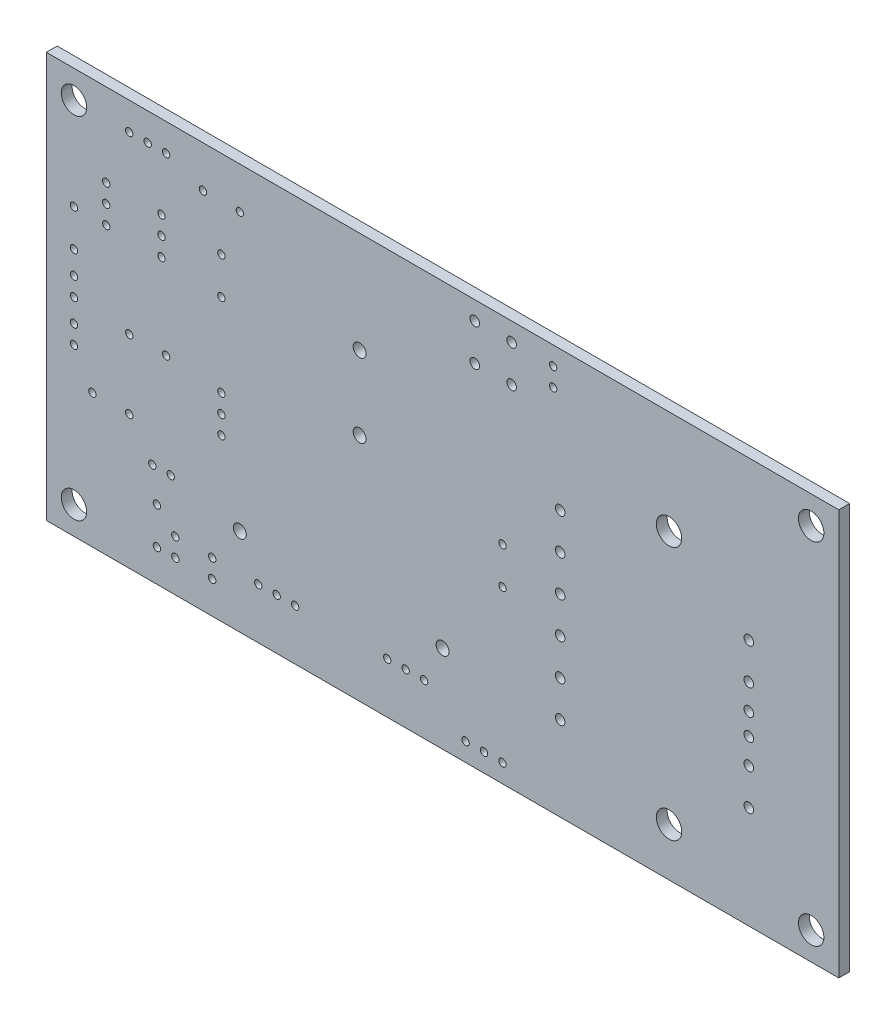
ISO-10303-21;
HEADER;
FILE_DESCRIPTION(('STEP AP214'),'2;1');
FILE_NAME('part.step','',(''),(''),'','','');
FILE_SCHEMA(('AUTOMOTIVE_DESIGN { 1 0 10303 214 1 1 1 1 }'));
ENDSEC;
DATA;
#1=APPLICATION_CONTEXT('core data for automotive mechanical design processes');
#2=APPLICATION_PROTOCOL_DEFINITION('international standard','automotive_design',2000,#1);
#3=PRODUCT_CONTEXT('',#1,'mechanical');
#4=PRODUCT('Part','Part','',(#3));
#5=PRODUCT_RELATED_PRODUCT_CATEGORY('part','',(#4));
#6=PRODUCT_DEFINITION_FORMATION('','',#4);
#7=PRODUCT_DEFINITION_CONTEXT('part definition',#1,'design');
#8=PRODUCT_DEFINITION('design','',#6,#7);
#9=PRODUCT_DEFINITION_SHAPE('','',#8);
#10=(LENGTH_UNIT() NAMED_UNIT(*) SI_UNIT(.MILLI.,.METRE.));
#11=(NAMED_UNIT(*) PLANE_ANGLE_UNIT() SI_UNIT($,.RADIAN.));
#12=(NAMED_UNIT(*) SI_UNIT($,.STERADIAN.) SOLID_ANGLE_UNIT());
#13=UNCERTAINTY_MEASURE_WITH_UNIT(LENGTH_MEASURE(1.E-05),#10,'distance_accuracy_value','');
#14=(GEOMETRIC_REPRESENTATION_CONTEXT(3) GLOBAL_UNCERTAINTY_ASSIGNED_CONTEXT((#13)) GLOBAL_UNIT_ASSIGNED_CONTEXT((#10,
#11,#12)) REPRESENTATION_CONTEXT('',''));
#15=CARTESIAN_POINT('',(0.,0.,0.));
#16=DIRECTION('',(0.,0.,1.));
#17=DIRECTION('',(1.,0.,0.));
#18=AXIS2_PLACEMENT_3D('',#15,#16,#17);
#19=CARTESIAN_POINT('',(0.,0.,1.4986));
#20=DIRECTION('',(1.,0.,0.));
#21=DIRECTION('',(0.,0.,-1.));
#22=AXIS2_PLACEMENT_3D('',#19,#20,#21);
#23=PLANE('',#22);
#24=DIRECTION('',(0.,-1.,0.));
#25=VECTOR('',#24,1.);
#26=CARTESIAN_POINT('',(0.,0.,0.));
#27=LINE('',#26,#25);
#28=CARTESIAN_POINT('',(0.,0.,0.));
#29=VERTEX_POINT('',#28);
#30=CARTESIAN_POINT('',(0.,-55.88,0.));
#31=VERTEX_POINT('',#30);
#32=EDGE_CURVE('E93',#29,#31,#27,.T.);
#33=ORIENTED_EDGE('',*,*,#32,.T.);
#34=DIRECTION('',(0.,0.,-1.));
#35=VECTOR('',#34,1.);
#36=CARTESIAN_POINT('',(0.,-55.88,1.4986));
#37=LINE('',#36,#35);
#38=CARTESIAN_POINT('',(0.,-55.88,1.4986));
#39=VERTEX_POINT('',#38);
#40=EDGE_CURVE('E11',#39,#31,#37,.T.);
#41=ORIENTED_EDGE('',*,*,#40,.F.);
#42=DIRECTION('',(0.,-1.,0.));
#43=VECTOR('',#42,1.);
#44=CARTESIAN_POINT('',(0.,0.,1.4986));
#45=LINE('',#44,#43);
#46=CARTESIAN_POINT('',(0.,0.,1.4986));
#47=VERTEX_POINT('',#46);
#48=EDGE_CURVE('E81',#47,#39,#45,.T.);
#49=ORIENTED_EDGE('',*,*,#48,.F.);
#50=DIRECTION('',(0.,0.,-1.));
#51=VECTOR('',#50,1.);
#52=CARTESIAN_POINT('',(0.,0.,1.4986));
#53=LINE('',#52,#51);
#54=EDGE_CURVE('E89',#47,#29,#53,.T.);
#55=ORIENTED_EDGE('',*,*,#54,.T.);
#56=EDGE_LOOP('',(#33,#41,#49,#55));
#57=FACE_BOUND('',#56,.T.);
#58=ADVANCED_FACE('F30',(#57),#23,.F.);
#59=CARTESIAN_POINT('',(0.,-55.88,1.4986));
#60=DIRECTION('',(0.,1.,0.));
#61=DIRECTION('',(0.,0.,1.));
#62=AXIS2_PLACEMENT_3D('',#59,#60,#61);
#63=PLANE('',#62);
#64=DIRECTION('',(1.,0.,0.));
#65=VECTOR('',#64,1.);
#66=CARTESIAN_POINT('',(0.,-55.88,0.));
#67=LINE('',#66,#65);
#68=CARTESIAN_POINT('',(109.22,-55.88,0.));
#69=VERTEX_POINT('',#68);
#70=EDGE_CURVE('E85',#31,#69,#67,.T.);
#71=ORIENTED_EDGE('',*,*,#70,.T.);
#72=DIRECTION('',(0.,0.,-1.));
#73=VECTOR('',#72,1.);
#74=CARTESIAN_POINT('',(109.22,-55.88,1.4986));
#75=LINE('',#74,#73);
#76=CARTESIAN_POINT('',(109.22,-55.88,1.4986));
#77=VERTEX_POINT('',#76);
#78=EDGE_CURVE('E38',#77,#69,#75,.T.);
#79=ORIENTED_EDGE('',*,*,#78,.F.);
#80=DIRECTION('',(1.,0.,0.));
#81=VECTOR('',#80,1.);
#82=CARTESIAN_POINT('',(0.,-55.88,1.4986));
#83=LINE('',#82,#81);
#84=EDGE_CURVE('E76',#39,#77,#83,.T.);
#85=ORIENTED_EDGE('',*,*,#84,.F.);
#86=ORIENTED_EDGE('',*,*,#40,.T.);
#87=EDGE_LOOP('',(#71,#79,#85,#86));
#88=FACE_BOUND('',#87,.T.);
#89=ADVANCED_FACE('F84',(#88),#63,.F.);
#90=CARTESIAN_POINT('',(109.22,0.,1.4986));
#91=DIRECTION('',(-1.,0.,0.));
#92=DIRECTION('',(0.,-1.,0.));
#93=AXIS2_PLACEMENT_3D('',#90,#91,#92);
#94=PLANE('',#93);
#95=DIRECTION('',(0.,1.,0.));
#96=VECTOR('',#95,1.);
#97=CARTESIAN_POINT('',(109.22,0.,0.));
#98=LINE('',#97,#96);
#99=CARTESIAN_POINT('',(109.22,0.,0.));
#100=VERTEX_POINT('',#99);
#101=EDGE_CURVE('E63',#69,#100,#98,.T.);
#102=ORIENTED_EDGE('',*,*,#101,.T.);
#103=DIRECTION('',(0.,0.,-1.));
#104=VECTOR('',#103,1.);
#105=CARTESIAN_POINT('',(109.22,0.,1.4986));
#106=LINE('',#105,#104);
#107=CARTESIAN_POINT('',(109.22,0.,1.4986));
#108=VERTEX_POINT('',#107);
#109=EDGE_CURVE('E86',#108,#100,#106,.T.);
#110=ORIENTED_EDGE('',*,*,#109,.F.);
#111=DIRECTION('',(0.,1.,0.));
#112=VECTOR('',#111,1.);
#113=CARTESIAN_POINT('',(109.22,0.,1.4986));
#114=LINE('',#113,#112);
#115=EDGE_CURVE('E79',#77,#108,#114,.T.);
#116=ORIENTED_EDGE('',*,*,#115,.F.);
#117=ORIENTED_EDGE('',*,*,#78,.T.);
#118=EDGE_LOOP('',(#102,#110,#116,#117));
#119=FACE_BOUND('',#118,.T.);
#120=ADVANCED_FACE('F87',(#119),#94,.F.);
#121=CARTESIAN_POINT('',(0.,0.,1.4986));
#122=DIRECTION('',(0.,-1.,0.));
#123=DIRECTION('',(0.,0.,-1.));
#124=AXIS2_PLACEMENT_3D('',#121,#122,#123);
#125=PLANE('',#124);
#126=DIRECTION('',(-1.,0.,0.));
#127=VECTOR('',#126,1.);
#128=CARTESIAN_POINT('',(0.,0.,0.));
#129=LINE('',#128,#127);
#130=EDGE_CURVE('E69',#100,#29,#129,.T.);
#131=ORIENTED_EDGE('',*,*,#130,.T.);
#132=ORIENTED_EDGE('',*,*,#54,.F.);
#133=DIRECTION('',(-1.,0.,0.));
#134=VECTOR('',#133,1.);
#135=CARTESIAN_POINT('',(0.,0.,1.4986));
#136=LINE('',#135,#134);
#137=EDGE_CURVE('E46',#108,#47,#136,.T.);
#138=ORIENTED_EDGE('',*,*,#137,.F.);
#139=ORIENTED_EDGE('',*,*,#109,.T.);
#140=EDGE_LOOP('',(#131,#132,#138,#139));
#141=FACE_BOUND('',#140,.T.);
#142=ADVANCED_FACE('F101',(#141),#125,.F.);
#143=CARTESIAN_POINT('',(0.,-55.88,1.4986));
#144=DIRECTION('',(0.,0.,1.));
#145=DIRECTION('',(1.,0.,0.));
#146=AXIS2_PLACEMENT_3D('',#143,#144,#145);
#147=PLANE('',#146);
#148=CARTESIAN_POINT('',(96.81972,-41.74998,1.4986));
#149=DIRECTION('',(0.,0.,1.));
#150=DIRECTION('',(1.,0.,0.));
#151=AXIS2_PLACEMENT_3D('',#148,#149,#150);
#152=CIRCLE('',#151,0.660400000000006);
#153=CARTESIAN_POINT('',(97.48012,-41.74998,1.4986));
#154=VERTEX_POINT('',#153);
#155=EDGE_CURVE('E541',#154,#154,#152,.T.);
#156=ORIENTED_EDGE('',*,*,#155,.F.);
#157=EDGE_LOOP('',(#156));
#158=FACE_BOUND('',#157,.T.);
#159=CARTESIAN_POINT('',(85.81898,-49.2506,1.4986));
#160=DIRECTION('',(0.,0.,1.));
#161=DIRECTION('',(1.,0.,0.));
#162=AXIS2_PLACEMENT_3D('',#159,#160,#161);
#163=CIRCLE('',#162,1.75259999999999);
#164=CARTESIAN_POINT('',(87.57158,-49.2506,1.4986));
#165=VERTEX_POINT('',#164);
#166=EDGE_CURVE('E535',#165,#165,#163,.T.);
#167=ORIENTED_EDGE('',*,*,#166,.F.);
#168=EDGE_LOOP('',(#167));
#169=FACE_BOUND('',#168,.T.);
#170=CARTESIAN_POINT('',(85.81898,-14.2494,1.4986));
#171=DIRECTION('',(0.,0.,1.));
#172=DIRECTION('',(1.,0.,0.));
#173=AXIS2_PLACEMENT_3D('',#170,#171,#172);
#174=CIRCLE('',#173,1.75259999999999);
#175=CARTESIAN_POINT('',(87.57158,-14.2494,1.4986));
#176=VERTEX_POINT('',#175);
#177=EDGE_CURVE('E529',#176,#176,#174,.T.);
#178=ORIENTED_EDGE('',*,*,#177,.F.);
#179=EDGE_LOOP('',(#178));
#180=FACE_BOUND('',#179,.T.);
#181=CARTESIAN_POINT('',(96.81972,-36.75126,1.4986));
#182=DIRECTION('',(0.,0.,1.));
#183=DIRECTION('',(1.,0.,0.));
#184=AXIS2_PLACEMENT_3D('',#181,#182,#183);
#185=CIRCLE('',#184,0.660400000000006);
#186=CARTESIAN_POINT('',(97.48012,-36.75126,1.4986));
#187=VERTEX_POINT('',#186);
#188=EDGE_CURVE('E523',#187,#187,#185,.T.);
#189=ORIENTED_EDGE('',*,*,#188,.F.);
#190=EDGE_LOOP('',(#189));
#191=FACE_BOUND('',#190,.T.);
#192=CARTESIAN_POINT('',(96.81972,-33.25114,1.4986));
#193=DIRECTION('',(0.,0.,1.));
#194=DIRECTION('',(1.,0.,0.));
#195=AXIS2_PLACEMENT_3D('',#192,#193,#194);
#196=CIRCLE('',#195,0.660400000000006);
#197=CARTESIAN_POINT('',(97.48012,-33.25114,1.4986));
#198=VERTEX_POINT('',#197);
#199=EDGE_CURVE('E517',#198,#198,#196,.T.);
#200=ORIENTED_EDGE('',*,*,#199,.F.);
#201=EDGE_LOOP('',(#200));
#202=FACE_BOUND('',#201,.T.);
#203=CARTESIAN_POINT('',(96.81972,-30.24886,1.4986));
#204=DIRECTION('',(0.,0.,1.));
#205=DIRECTION('',(1.,0.,0.));
#206=AXIS2_PLACEMENT_3D('',#203,#204,#205);
#207=CIRCLE('',#206,0.660400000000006);
#208=CARTESIAN_POINT('',(97.48012,-30.24886,1.4986));
#209=VERTEX_POINT('',#208);
#210=EDGE_CURVE('E511',#209,#209,#207,.T.);
#211=ORIENTED_EDGE('',*,*,#210,.F.);
#212=EDGE_LOOP('',(#211));
#213=FACE_BOUND('',#212,.T.);
#214=CARTESIAN_POINT('',(96.81972,-26.74874,1.4986));
#215=DIRECTION('',(0.,0.,1.));
#216=DIRECTION('',(1.,0.,0.));
#217=AXIS2_PLACEMENT_3D('',#214,#215,#216);
#218=CIRCLE('',#217,0.660400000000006);
#219=CARTESIAN_POINT('',(97.48012,-26.74874,1.4986));
#220=VERTEX_POINT('',#219);
#221=EDGE_CURVE('E505',#220,#220,#218,.T.);
#222=ORIENTED_EDGE('',*,*,#221,.F.);
#223=EDGE_LOOP('',(#222));
#224=FACE_BOUND('',#223,.T.);
#225=CARTESIAN_POINT('',(96.81972,-21.75002,1.4986));
#226=DIRECTION('',(0.,0.,1.));
#227=DIRECTION('',(1.,0.,0.));
#228=AXIS2_PLACEMENT_3D('',#225,#226,#227);
#229=CIRCLE('',#228,0.660400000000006);
#230=CARTESIAN_POINT('',(97.48012,-21.75002,1.4986));
#231=VERTEX_POINT('',#230);
#232=EDGE_CURVE('E499',#231,#231,#229,.T.);
#233=ORIENTED_EDGE('',*,*,#232,.F.);
#234=EDGE_LOOP('',(#233));
#235=FACE_BOUND('',#234,.T.);
#236=CARTESIAN_POINT('',(70.82028,-44.24934,1.4986));
#237=DIRECTION('',(0.,0.,1.));
#238=DIRECTION('',(1.,0.,0.));
#239=AXIS2_PLACEMENT_3D('',#236,#237,#238);
#240=CIRCLE('',#239,0.660400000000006);
#241=CARTESIAN_POINT('',(71.48068,-44.24934,1.4986));
#242=VERTEX_POINT('',#241);
#243=EDGE_CURVE('E493',#242,#242,#240,.T.);
#244=ORIENTED_EDGE('',*,*,#243,.F.);
#245=EDGE_LOOP('',(#244));
#246=FACE_BOUND('',#245,.T.);
#247=CARTESIAN_POINT('',(70.82028,-39.25062,1.4986));
#248=DIRECTION('',(0.,0.,1.));
#249=DIRECTION('',(1.,0.,0.));
#250=AXIS2_PLACEMENT_3D('',#247,#248,#249);
#251=CIRCLE('',#250,0.660400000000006);
#252=CARTESIAN_POINT('',(71.48068,-39.25062,1.4986));
#253=VERTEX_POINT('',#252);
#254=EDGE_CURVE('E487',#253,#253,#251,.T.);
#255=ORIENTED_EDGE('',*,*,#254,.F.);
#256=EDGE_LOOP('',(#255));
#257=FACE_BOUND('',#256,.T.);
#258=CARTESIAN_POINT('',(70.82028,-34.24936,1.4986));
#259=DIRECTION('',(0.,0.,1.));
#260=DIRECTION('',(1.,0.,0.));
#261=AXIS2_PLACEMENT_3D('',#258,#259,#260);
#262=CIRCLE('',#261,0.660400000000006);
#263=CARTESIAN_POINT('',(71.48068,-34.24936,1.4986));
#264=VERTEX_POINT('',#263);
#265=EDGE_CURVE('E481',#264,#264,#262,.T.);
#266=ORIENTED_EDGE('',*,*,#265,.F.);
#267=EDGE_LOOP('',(#266));
#268=FACE_BOUND('',#267,.T.);
#269=CARTESIAN_POINT('',(70.82028,-29.25064,1.4986));
#270=DIRECTION('',(0.,0.,1.));
#271=DIRECTION('',(1.,0.,0.));
#272=AXIS2_PLACEMENT_3D('',#269,#270,#271);
#273=CIRCLE('',#272,0.660400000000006);
#274=CARTESIAN_POINT('',(71.48068,-29.25064,1.4986));
#275=VERTEX_POINT('',#274);
#276=EDGE_CURVE('E475',#275,#275,#273,.T.);
#277=ORIENTED_EDGE('',*,*,#276,.F.);
#278=EDGE_LOOP('',(#277));
#279=FACE_BOUND('',#278,.T.);
#280=CARTESIAN_POINT('',(70.82028,-24.24938,1.4986));
#281=DIRECTION('',(0.,0.,1.));
#282=DIRECTION('',(1.,0.,0.));
#283=AXIS2_PLACEMENT_3D('',#280,#281,#282);
#284=CIRCLE('',#283,0.660400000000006);
#285=CARTESIAN_POINT('',(71.48068,-24.24938,1.4986));
#286=VERTEX_POINT('',#285);
#287=EDGE_CURVE('E469',#286,#286,#284,.T.);
#288=ORIENTED_EDGE('',*,*,#287,.F.);
#289=EDGE_LOOP('',(#288));
#290=FACE_BOUND('',#289,.T.);
#291=CARTESIAN_POINT('',(70.82028,-19.25066,1.4986));
#292=DIRECTION('',(0.,0.,1.));
#293=DIRECTION('',(1.,0.,0.));
#294=AXIS2_PLACEMENT_3D('',#291,#292,#293);
#295=CIRCLE('',#294,0.660400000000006);
#296=CARTESIAN_POINT('',(71.48068,-19.25066,1.4986));
#297=VERTEX_POINT('',#296);
#298=EDGE_CURVE('E463',#297,#297,#295,.T.);
#299=ORIENTED_EDGE('',*,*,#298,.F.);
#300=EDGE_LOOP('',(#299));
#301=FACE_BOUND('',#300,.T.);
#302=CARTESIAN_POINT('',(69.85,-5.08,1.4986));
#303=DIRECTION('',(0.,0.,1.));
#304=DIRECTION('',(1.,0.,0.));
#305=AXIS2_PLACEMENT_3D('',#302,#303,#304);
#306=CIRCLE('',#305,0.507999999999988);
#307=CARTESIAN_POINT('',(70.358,-5.08,1.4986));
#308=VERTEX_POINT('',#307);
#309=EDGE_CURVE('E457',#308,#308,#306,.T.);
#310=ORIENTED_EDGE('',*,*,#309,.F.);
#311=EDGE_LOOP('',(#310));
#312=FACE_BOUND('',#311,.T.);
#313=CARTESIAN_POINT('',(69.85,-2.54,1.4986));
#314=DIRECTION('',(0.,0.,1.));
#315=DIRECTION('',(1.,0.,0.));
#316=AXIS2_PLACEMENT_3D('',#313,#314,#315);
#317=CIRCLE('',#316,0.507999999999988);
#318=CARTESIAN_POINT('',(70.358,-2.54,1.4986));
#319=VERTEX_POINT('',#318);
#320=EDGE_CURVE('E451',#319,#319,#317,.T.);
#321=ORIENTED_EDGE('',*,*,#320,.F.);
#322=EDGE_LOOP('',(#321));
#323=FACE_BOUND('',#322,.T.);
#324=CARTESIAN_POINT('',(64.135,-7.62,1.4986));
#325=DIRECTION('',(0.,0.,1.));
#326=DIRECTION('',(1.,0.,0.));
#327=AXIS2_PLACEMENT_3D('',#324,#325,#326);
#328=CIRCLE('',#327,0.660400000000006);
#329=CARTESIAN_POINT('',(64.7954,-7.62,1.4986));
#330=VERTEX_POINT('',#329);
#331=EDGE_CURVE('E445',#330,#330,#328,.T.);
#332=ORIENTED_EDGE('',*,*,#331,.F.);
#333=EDGE_LOOP('',(#332));
#334=FACE_BOUND('',#333,.T.);
#335=CARTESIAN_POINT('',(59.055,-7.62,1.4986));
#336=DIRECTION('',(0.,0.,1.));
#337=DIRECTION('',(1.,0.,0.));
#338=AXIS2_PLACEMENT_3D('',#335,#336,#337);
#339=CIRCLE('',#338,0.660399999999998);
#340=CARTESIAN_POINT('',(59.7154,-7.62,1.4986));
#341=VERTEX_POINT('',#340);
#342=EDGE_CURVE('E439',#341,#341,#339,.T.);
#343=ORIENTED_EDGE('',*,*,#342,.F.);
#344=EDGE_LOOP('',(#343));
#345=FACE_BOUND('',#344,.T.);
#346=CARTESIAN_POINT('',(64.135,-2.54,1.4986));
#347=DIRECTION('',(0.,0.,1.));
#348=DIRECTION('',(1.,0.,0.));
#349=AXIS2_PLACEMENT_3D('',#346,#347,#348);
#350=CIRCLE('',#349,0.660400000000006);
#351=CARTESIAN_POINT('',(64.7954,-2.54,1.4986));
#352=VERTEX_POINT('',#351);
#353=EDGE_CURVE('E433',#352,#352,#350,.T.);
#354=ORIENTED_EDGE('',*,*,#353,.F.);
#355=EDGE_LOOP('',(#354));
#356=FACE_BOUND('',#355,.T.);
#357=CARTESIAN_POINT('',(59.055,-2.54,1.4986));
#358=DIRECTION('',(0.,0.,1.));
#359=DIRECTION('',(1.,0.,0.));
#360=AXIS2_PLACEMENT_3D('',#357,#358,#359);
#361=CIRCLE('',#360,0.660399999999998);
#362=CARTESIAN_POINT('',(59.7154,-2.54,1.4986));
#363=VERTEX_POINT('',#362);
#364=EDGE_CURVE('E427',#363,#363,#361,.T.);
#365=ORIENTED_EDGE('',*,*,#364,.F.);
#366=EDGE_LOOP('',(#365));
#367=FACE_BOUND('',#366,.T.);
#368=CARTESIAN_POINT('',(43.18,-13.97,1.4986));
#369=DIRECTION('',(0.,0.,1.));
#370=DIRECTION('',(1.,0.,0.));
#371=AXIS2_PLACEMENT_3D('',#368,#369,#370);
#372=CIRCLE('',#371,0.889000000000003);
#373=CARTESIAN_POINT('',(44.069,-13.97,1.4986));
#374=VERTEX_POINT('',#373);
#375=EDGE_CURVE('E421',#374,#374,#372,.T.);
#376=ORIENTED_EDGE('',*,*,#375,.F.);
#377=EDGE_LOOP('',(#376));
#378=FACE_BOUND('',#377,.T.);
#379=CARTESIAN_POINT('',(43.18,-24.13,1.4986));
#380=DIRECTION('',(0.,0.,1.));
#381=DIRECTION('',(1.,0.,0.));
#382=AXIS2_PLACEMENT_3D('',#379,#380,#381);
#383=CIRCLE('',#382,0.889000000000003);
#384=CARTESIAN_POINT('',(44.069,-24.13,1.4986));
#385=VERTEX_POINT('',#384);
#386=EDGE_CURVE('E415',#385,#385,#383,.T.);
#387=ORIENTED_EDGE('',*,*,#386,.F.);
#388=EDGE_LOOP('',(#387));
#389=FACE_BOUND('',#388,.T.);
#390=CARTESIAN_POINT('',(62.865,-27.305,1.4986));
#391=DIRECTION('',(0.,0.,1.));
#392=DIRECTION('',(1.,0.,0.));
#393=AXIS2_PLACEMENT_3D('',#390,#391,#392);
#394=CIRCLE('',#393,0.507999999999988);
#395=CARTESIAN_POINT('',(63.373,-27.305,1.4986));
#396=VERTEX_POINT('',#395);
#397=EDGE_CURVE('E409',#396,#396,#394,.T.);
#398=ORIENTED_EDGE('',*,*,#397,.F.);
#399=EDGE_LOOP('',(#398));
#400=FACE_BOUND('',#399,.T.);
#401=CARTESIAN_POINT('',(62.865,-32.385,1.4986));
#402=DIRECTION('',(0.,0.,1.));
#403=DIRECTION('',(1.,0.,0.));
#404=AXIS2_PLACEMENT_3D('',#401,#402,#403);
#405=CIRCLE('',#404,0.507999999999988);
#406=CARTESIAN_POINT('',(63.373,-32.385,1.4986));
#407=VERTEX_POINT('',#406);
#408=EDGE_CURVE('E403',#407,#407,#405,.T.);
#409=ORIENTED_EDGE('',*,*,#408,.F.);
#410=EDGE_LOOP('',(#409));
#411=FACE_BOUND('',#410,.T.);
#412=CARTESIAN_POINT('',(62.865,-53.34,1.4986));
#413=DIRECTION('',(0.,0.,1.));
#414=DIRECTION('',(1.,0.,0.));
#415=AXIS2_PLACEMENT_3D('',#412,#413,#414);
#416=CIRCLE('',#415,0.507999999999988);
#417=CARTESIAN_POINT('',(63.373,-53.34,1.4986));
#418=VERTEX_POINT('',#417);
#419=EDGE_CURVE('E397',#418,#418,#416,.T.);
#420=ORIENTED_EDGE('',*,*,#419,.F.);
#421=EDGE_LOOP('',(#420));
#422=FACE_BOUND('',#421,.T.);
#423=CARTESIAN_POINT('',(60.325,-53.34,1.4986));
#424=DIRECTION('',(0.,0.,1.));
#425=DIRECTION('',(1.,0.,0.));
#426=AXIS2_PLACEMENT_3D('',#423,#424,#425);
#427=CIRCLE('',#426,0.508000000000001);
#428=CARTESIAN_POINT('',(60.833,-53.34,1.4986));
#429=VERTEX_POINT('',#428);
#430=EDGE_CURVE('E391',#429,#429,#427,.T.);
#431=ORIENTED_EDGE('',*,*,#430,.F.);
#432=EDGE_LOOP('',(#431));
#433=FACE_BOUND('',#432,.T.);
#434=CARTESIAN_POINT('',(57.785,-53.34,1.4986));
#435=DIRECTION('',(0.,0.,1.));
#436=DIRECTION('',(1.,0.,0.));
#437=AXIS2_PLACEMENT_3D('',#434,#435,#436);
#438=CIRCLE('',#437,0.508000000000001);
#439=CARTESIAN_POINT('',(58.293,-53.34,1.4986));
#440=VERTEX_POINT('',#439);
#441=EDGE_CURVE('E385',#440,#440,#438,.T.);
#442=ORIENTED_EDGE('',*,*,#441,.F.);
#443=EDGE_LOOP('',(#442));
#444=FACE_BOUND('',#443,.T.);
#445=CARTESIAN_POINT('',(52.07,-48.895,1.4986));
#446=DIRECTION('',(0.,0.,1.));
#447=DIRECTION('',(1.,0.,0.));
#448=AXIS2_PLACEMENT_3D('',#445,#446,#447);
#449=CIRCLE('',#448,0.508000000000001);
#450=CARTESIAN_POINT('',(52.578,-48.895,1.4986));
#451=VERTEX_POINT('',#450);
#452=EDGE_CURVE('E379',#451,#451,#449,.T.);
#453=ORIENTED_EDGE('',*,*,#452,.F.);
#454=EDGE_LOOP('',(#453));
#455=FACE_BOUND('',#454,.T.);
#456=CARTESIAN_POINT('',(49.53,-48.895,1.4986));
#457=DIRECTION('',(0.,0.,1.));
#458=DIRECTION('',(1.,0.,0.));
#459=AXIS2_PLACEMENT_3D('',#456,#457,#458);
#460=CIRCLE('',#459,0.508000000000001);
#461=CARTESIAN_POINT('',(50.038,-48.895,1.4986));
#462=VERTEX_POINT('',#461);
#463=EDGE_CURVE('E373',#462,#462,#460,.T.);
#464=ORIENTED_EDGE('',*,*,#463,.F.);
#465=EDGE_LOOP('',(#464));
#466=FACE_BOUND('',#465,.T.);
#467=CARTESIAN_POINT('',(46.99,-48.895,1.4986));
#468=DIRECTION('',(0.,0.,1.));
#469=DIRECTION('',(1.,0.,0.));
#470=AXIS2_PLACEMENT_3D('',#467,#468,#469);
#471=CIRCLE('',#470,0.508000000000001);
#472=CARTESIAN_POINT('',(47.498,-48.895,1.4986));
#473=VERTEX_POINT('',#472);
#474=EDGE_CURVE('E367',#473,#473,#471,.T.);
#475=ORIENTED_EDGE('',*,*,#474,.F.);
#476=EDGE_LOOP('',(#475));
#477=FACE_BOUND('',#476,.T.);
#478=CARTESIAN_POINT('',(34.29,-48.895,1.4986));
#479=DIRECTION('',(0.,0.,1.));
#480=DIRECTION('',(1.,0.,0.));
#481=AXIS2_PLACEMENT_3D('',#478,#479,#480);
#482=CIRCLE('',#481,0.508000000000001);
#483=CARTESIAN_POINT('',(34.798,-48.895,1.4986));
#484=VERTEX_POINT('',#483);
#485=EDGE_CURVE('E361',#484,#484,#482,.T.);
#486=ORIENTED_EDGE('',*,*,#485,.F.);
#487=EDGE_LOOP('',(#486));
#488=FACE_BOUND('',#487,.T.);
#489=CARTESIAN_POINT('',(31.75,-48.895,1.4986));
#490=DIRECTION('',(0.,0.,1.));
#491=DIRECTION('',(1.,0.,0.));
#492=AXIS2_PLACEMENT_3D('',#489,#490,#491);
#493=CIRCLE('',#492,0.508000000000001);
#494=CARTESIAN_POINT('',(32.258,-48.895,1.4986));
#495=VERTEX_POINT('',#494);
#496=EDGE_CURVE('E355',#495,#495,#493,.T.);
#497=ORIENTED_EDGE('',*,*,#496,.F.);
#498=EDGE_LOOP('',(#497));
#499=FACE_BOUND('',#498,.T.);
#500=CARTESIAN_POINT('',(29.21,-48.895,1.4986));
#501=DIRECTION('',(0.,0.,1.));
#502=DIRECTION('',(1.,0.,0.));
#503=AXIS2_PLACEMENT_3D('',#500,#501,#502);
#504=CIRCLE('',#503,0.508000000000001);
#505=CARTESIAN_POINT('',(29.718,-48.895,1.4986));
#506=VERTEX_POINT('',#505);
#507=EDGE_CURVE('E349',#506,#506,#504,.T.);
#508=ORIENTED_EDGE('',*,*,#507,.F.);
#509=EDGE_LOOP('',(#508));
#510=FACE_BOUND('',#509,.T.);
#511=CARTESIAN_POINT('',(54.61,-43.815,1.4986));
#512=DIRECTION('',(0.,0.,1.));
#513=DIRECTION('',(1.,0.,0.));
#514=AXIS2_PLACEMENT_3D('',#511,#512,#513);
#515=CIRCLE('',#514,0.889000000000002);
#516=CARTESIAN_POINT('',(55.499,-43.815,1.4986));
#517=VERTEX_POINT('',#516);
#518=EDGE_CURVE('E343',#517,#517,#515,.T.);
#519=ORIENTED_EDGE('',*,*,#518,.F.);
#520=EDGE_LOOP('',(#519));
#521=FACE_BOUND('',#520,.T.);
#522=CARTESIAN_POINT('',(26.67,-43.815,1.4986));
#523=DIRECTION('',(0.,0.,1.));
#524=DIRECTION('',(1.,0.,0.));
#525=AXIS2_PLACEMENT_3D('',#522,#523,#524);
#526=CIRCLE('',#525,0.888999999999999);
#527=CARTESIAN_POINT('',(27.559,-43.815,1.4986));
#528=VERTEX_POINT('',#527);
#529=EDGE_CURVE('E337',#528,#528,#526,.T.);
#530=ORIENTED_EDGE('',*,*,#529,.F.);
#531=EDGE_LOOP('',(#530));
#532=FACE_BOUND('',#531,.T.);
#533=CARTESIAN_POINT('',(22.86,-51.435,1.4986));
#534=DIRECTION('',(0.,0.,1.));
#535=DIRECTION('',(1.,0.,0.));
#536=AXIS2_PLACEMENT_3D('',#533,#534,#535);
#537=CIRCLE('',#536,0.508000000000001);
#538=CARTESIAN_POINT('',(23.368,-51.435,1.4986));
#539=VERTEX_POINT('',#538);
#540=EDGE_CURVE('E331',#539,#539,#537,.T.);
#541=ORIENTED_EDGE('',*,*,#540,.F.);
#542=EDGE_LOOP('',(#541));
#543=FACE_BOUND('',#542,.T.);
#544=CARTESIAN_POINT('',(17.78,-51.435,1.4986));
#545=DIRECTION('',(0.,0.,1.));
#546=DIRECTION('',(1.,0.,0.));
#547=AXIS2_PLACEMENT_3D('',#544,#545,#546);
#548=CIRCLE('',#547,0.508000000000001);
#549=CARTESIAN_POINT('',(18.288,-51.435,1.4986));
#550=VERTEX_POINT('',#549);
#551=EDGE_CURVE('E325',#550,#550,#548,.T.);
#552=ORIENTED_EDGE('',*,*,#551,.F.);
#553=EDGE_LOOP('',(#552));
#554=FACE_BOUND('',#553,.T.);
#555=CARTESIAN_POINT('',(22.86,-48.895,1.4986));
#556=DIRECTION('',(0.,0.,1.));
#557=DIRECTION('',(1.,0.,0.));
#558=AXIS2_PLACEMENT_3D('',#555,#556,#557);
#559=CIRCLE('',#558,0.508000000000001);
#560=CARTESIAN_POINT('',(23.368,-48.895,1.4986));
#561=VERTEX_POINT('',#560);
#562=EDGE_CURVE('E319',#561,#561,#559,.T.);
#563=ORIENTED_EDGE('',*,*,#562,.F.);
#564=EDGE_LOOP('',(#563));
#565=FACE_BOUND('',#564,.T.);
#566=CARTESIAN_POINT('',(17.78,-48.895,1.4986));
#567=DIRECTION('',(0.,0.,1.));
#568=DIRECTION('',(1.,0.,0.));
#569=AXIS2_PLACEMENT_3D('',#566,#567,#568);
#570=CIRCLE('',#569,0.508000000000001);
#571=CARTESIAN_POINT('',(18.288,-48.895,1.4986));
#572=VERTEX_POINT('',#571);
#573=EDGE_CURVE('E313',#572,#572,#570,.T.);
#574=ORIENTED_EDGE('',*,*,#573,.F.);
#575=EDGE_LOOP('',(#574));
#576=FACE_BOUND('',#575,.T.);
#577=CARTESIAN_POINT('',(15.24,-51.435,1.4986));
#578=DIRECTION('',(0.,0.,1.));
#579=DIRECTION('',(1.,0.,0.));
#580=AXIS2_PLACEMENT_3D('',#577,#578,#579);
#581=CIRCLE('',#580,0.507999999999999);
#582=CARTESIAN_POINT('',(15.748,-51.435,1.4986));
#583=VERTEX_POINT('',#582);
#584=EDGE_CURVE('E307',#583,#583,#581,.T.);
#585=ORIENTED_EDGE('',*,*,#584,.F.);
#586=EDGE_LOOP('',(#585));
#587=FACE_BOUND('',#586,.T.);
#588=CARTESIAN_POINT('',(15.24,-46.355,1.4986));
#589=DIRECTION('',(0.,0.,1.));
#590=DIRECTION('',(1.,0.,0.));
#591=AXIS2_PLACEMENT_3D('',#588,#589,#590);
#592=CIRCLE('',#591,0.507999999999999);
#593=CARTESIAN_POINT('',(15.748,-46.355,1.4986));
#594=VERTEX_POINT('',#593);
#595=EDGE_CURVE('E301',#594,#594,#592,.T.);
#596=ORIENTED_EDGE('',*,*,#595,.F.);
#597=EDGE_LOOP('',(#596));
#598=FACE_BOUND('',#597,.T.);
#599=CARTESIAN_POINT('',(17.145,-41.91,1.4986));
#600=DIRECTION('',(0.,0.,1.));
#601=DIRECTION('',(1.,0.,0.));
#602=AXIS2_PLACEMENT_3D('',#599,#600,#601);
#603=CIRCLE('',#602,0.508000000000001);
#604=CARTESIAN_POINT('',(17.653,-41.91,1.4986));
#605=VERTEX_POINT('',#604);
#606=EDGE_CURVE('E295',#605,#605,#603,.T.);
#607=ORIENTED_EDGE('',*,*,#606,.F.);
#608=EDGE_LOOP('',(#607));
#609=FACE_BOUND('',#608,.T.);
#610=CARTESIAN_POINT('',(14.605,-41.91,1.4986));
#611=DIRECTION('',(0.,0.,1.));
#612=DIRECTION('',(1.,0.,0.));
#613=AXIS2_PLACEMENT_3D('',#610,#611,#612);
#614=CIRCLE('',#613,0.507999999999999);
#615=CARTESIAN_POINT('',(15.113,-41.91,1.4986));
#616=VERTEX_POINT('',#615);
#617=EDGE_CURVE('E289',#616,#616,#614,.T.);
#618=ORIENTED_EDGE('',*,*,#617,.F.);
#619=EDGE_LOOP('',(#618));
#620=FACE_BOUND('',#619,.T.);
#621=CARTESIAN_POINT('',(11.43,-37.465,1.4986));
#622=DIRECTION('',(0.,0.,1.));
#623=DIRECTION('',(1.,0.,0.));
#624=AXIS2_PLACEMENT_3D('',#621,#622,#623);
#625=CIRCLE('',#624,0.507999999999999);
#626=CARTESIAN_POINT('',(11.938,-37.465,1.4986));
#627=VERTEX_POINT('',#626);
#628=EDGE_CURVE('E283',#627,#627,#625,.T.);
#629=ORIENTED_EDGE('',*,*,#628,.F.);
#630=EDGE_LOOP('',(#629));
#631=FACE_BOUND('',#630,.T.);
#632=CARTESIAN_POINT('',(6.35,-37.465,1.4986));
#633=DIRECTION('',(0.,0.,1.));
#634=DIRECTION('',(1.,0.,0.));
#635=AXIS2_PLACEMENT_3D('',#632,#633,#634);
#636=CIRCLE('',#635,0.507999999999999);
#637=CARTESIAN_POINT('',(6.858,-37.465,1.4986));
#638=VERTEX_POINT('',#637);
#639=EDGE_CURVE('E277',#638,#638,#636,.T.);
#640=ORIENTED_EDGE('',*,*,#639,.F.);
#641=EDGE_LOOP('',(#640));
#642=FACE_BOUND('',#641,.T.);
#643=CARTESIAN_POINT('',(24.13,-33.655,1.4986));
#644=DIRECTION('',(0.,0.,1.));
#645=DIRECTION('',(1.,0.,0.));
#646=AXIS2_PLACEMENT_3D('',#643,#644,#645);
#647=CIRCLE('',#646,0.508000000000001);
#648=CARTESIAN_POINT('',(24.638,-33.655,1.4986));
#649=VERTEX_POINT('',#648);
#650=EDGE_CURVE('E271',#649,#649,#647,.T.);
#651=ORIENTED_EDGE('',*,*,#650,.F.);
#652=EDGE_LOOP('',(#651));
#653=FACE_BOUND('',#652,.T.);
#654=CARTESIAN_POINT('',(24.13,-31.115,1.4986));
#655=DIRECTION('',(0.,0.,1.));
#656=DIRECTION('',(1.,0.,0.));
#657=AXIS2_PLACEMENT_3D('',#654,#655,#656);
#658=CIRCLE('',#657,0.508000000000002);
#659=CARTESIAN_POINT('',(24.638,-31.115,1.4986));
#660=VERTEX_POINT('',#659);
#661=EDGE_CURVE('E265',#660,#660,#658,.T.);
#662=ORIENTED_EDGE('',*,*,#661,.F.);
#663=EDGE_LOOP('',(#662));
#664=FACE_BOUND('',#663,.T.);
#665=CARTESIAN_POINT('',(24.13,-28.575,1.4986));
#666=DIRECTION('',(0.,0.,1.));
#667=DIRECTION('',(1.,0.,0.));
#668=AXIS2_PLACEMENT_3D('',#665,#666,#667);
#669=CIRCLE('',#668,0.508000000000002);
#670=CARTESIAN_POINT('',(24.638,-28.575,1.4986));
#671=VERTEX_POINT('',#670);
#672=EDGE_CURVE('E259',#671,#671,#669,.T.);
#673=ORIENTED_EDGE('',*,*,#672,.F.);
#674=EDGE_LOOP('',(#673));
#675=FACE_BOUND('',#674,.T.);
#676=CARTESIAN_POINT('',(16.51,-27.94,1.4986));
#677=DIRECTION('',(0.,0.,1.));
#678=DIRECTION('',(1.,0.,0.));
#679=AXIS2_PLACEMENT_3D('',#676,#677,#678);
#680=CIRCLE('',#679,0.508000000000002);
#681=CARTESIAN_POINT('',(17.018,-27.94,1.4986));
#682=VERTEX_POINT('',#681);
#683=EDGE_CURVE('E253',#682,#682,#680,.T.);
#684=ORIENTED_EDGE('',*,*,#683,.F.);
#685=EDGE_LOOP('',(#684));
#686=FACE_BOUND('',#685,.T.);
#687=CARTESIAN_POINT('',(11.43,-27.94,1.4986));
#688=DIRECTION('',(0.,0.,1.));
#689=DIRECTION('',(1.,0.,0.));
#690=AXIS2_PLACEMENT_3D('',#687,#688,#689);
#691=CIRCLE('',#690,0.508);
#692=CARTESIAN_POINT('',(11.938,-27.94,1.4986));
#693=VERTEX_POINT('',#692);
#694=EDGE_CURVE('E247',#693,#693,#691,.T.);
#695=ORIENTED_EDGE('',*,*,#694,.F.);
#696=EDGE_LOOP('',(#695));
#697=FACE_BOUND('',#696,.T.);
#698=CARTESIAN_POINT('',(3.81,-33.02,1.4986));
#699=DIRECTION('',(0.,0.,1.));
#700=DIRECTION('',(1.,0.,0.));
#701=AXIS2_PLACEMENT_3D('',#698,#699,#700);
#702=CIRCLE('',#701,0.508);
#703=CARTESIAN_POINT('',(4.318,-33.02,1.4986));
#704=VERTEX_POINT('',#703);
#705=EDGE_CURVE('E241',#704,#704,#702,.T.);
#706=ORIENTED_EDGE('',*,*,#705,.F.);
#707=EDGE_LOOP('',(#706));
#708=FACE_BOUND('',#707,.T.);
#709=CARTESIAN_POINT('',(3.81,-30.48,1.4986));
#710=DIRECTION('',(0.,0.,1.));
#711=DIRECTION('',(1.,0.,0.));
#712=AXIS2_PLACEMENT_3D('',#709,#710,#711);
#713=CIRCLE('',#712,0.508000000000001);
#714=CARTESIAN_POINT('',(4.318,-30.48,1.4986));
#715=VERTEX_POINT('',#714);
#716=EDGE_CURVE('E235',#715,#715,#713,.T.);
#717=ORIENTED_EDGE('',*,*,#716,.F.);
#718=EDGE_LOOP('',(#717));
#719=FACE_BOUND('',#718,.T.);
#720=CARTESIAN_POINT('',(3.81,-27.305,1.4986));
#721=DIRECTION('',(0.,0.,1.));
#722=DIRECTION('',(1.,0.,0.));
#723=AXIS2_PLACEMENT_3D('',#720,#721,#722);
#724=CIRCLE('',#723,0.508000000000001);
#725=CARTESIAN_POINT('',(4.318,-27.305,1.4986));
#726=VERTEX_POINT('',#725);
#727=EDGE_CURVE('E229',#726,#726,#724,.T.);
#728=ORIENTED_EDGE('',*,*,#727,.F.);
#729=EDGE_LOOP('',(#728));
#730=FACE_BOUND('',#729,.T.);
#731=CARTESIAN_POINT('',(3.81,-24.765,1.4986));
#732=DIRECTION('',(0.,0.,1.));
#733=DIRECTION('',(1.,0.,0.));
#734=AXIS2_PLACEMENT_3D('',#731,#732,#733);
#735=CIRCLE('',#734,0.508000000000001);
#736=CARTESIAN_POINT('',(4.318,-24.765,1.4986));
#737=VERTEX_POINT('',#736);
#738=EDGE_CURVE('E223',#737,#737,#735,.T.);
#739=ORIENTED_EDGE('',*,*,#738,.F.);
#740=EDGE_LOOP('',(#739));
#741=FACE_BOUND('',#740,.T.);
#742=CARTESIAN_POINT('',(3.81,-21.59,1.4986));
#743=DIRECTION('',(0.,0.,1.));
#744=DIRECTION('',(1.,0.,0.));
#745=AXIS2_PLACEMENT_3D('',#742,#743,#744);
#746=CIRCLE('',#745,0.508000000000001);
#747=CARTESIAN_POINT('',(4.318,-21.59,1.4986));
#748=VERTEX_POINT('',#747);
#749=EDGE_CURVE('E217',#748,#748,#746,.T.);
#750=ORIENTED_EDGE('',*,*,#749,.F.);
#751=EDGE_LOOP('',(#750));
#752=FACE_BOUND('',#751,.T.);
#753=CARTESIAN_POINT('',(3.81,-16.51,1.4986));
#754=DIRECTION('',(0.,0.,1.));
#755=DIRECTION('',(1.,0.,0.));
#756=AXIS2_PLACEMENT_3D('',#753,#754,#755);
#757=CIRCLE('',#756,0.508000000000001);
#758=CARTESIAN_POINT('',(4.318,-16.51,1.4986));
#759=VERTEX_POINT('',#758);
#760=EDGE_CURVE('E211',#759,#759,#757,.T.);
#761=ORIENTED_EDGE('',*,*,#760,.F.);
#762=EDGE_LOOP('',(#761));
#763=FACE_BOUND('',#762,.T.);
#764=CARTESIAN_POINT('',(24.13,-17.145,1.4986));
#765=DIRECTION('',(0.,0.,1.));
#766=DIRECTION('',(1.,0.,0.));
#767=AXIS2_PLACEMENT_3D('',#764,#765,#766);
#768=CIRCLE('',#767,0.508000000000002);
#769=CARTESIAN_POINT('',(24.638,-17.145,1.4986));
#770=VERTEX_POINT('',#769);
#771=EDGE_CURVE('E205',#770,#770,#768,.T.);
#772=ORIENTED_EDGE('',*,*,#771,.F.);
#773=EDGE_LOOP('',(#772));
#774=FACE_BOUND('',#773,.T.);
#775=CARTESIAN_POINT('',(24.13,-12.065,1.4986));
#776=DIRECTION('',(0.,0.,1.));
#777=DIRECTION('',(1.,0.,0.));
#778=AXIS2_PLACEMENT_3D('',#775,#776,#777);
#779=CIRCLE('',#778,0.508000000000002);
#780=CARTESIAN_POINT('',(24.638,-12.065,1.4986));
#781=VERTEX_POINT('',#780);
#782=EDGE_CURVE('E199',#781,#781,#779,.T.);
#783=ORIENTED_EDGE('',*,*,#782,.F.);
#784=EDGE_LOOP('',(#783));
#785=FACE_BOUND('',#784,.T.);
#786=CARTESIAN_POINT('',(15.875,-16.51,1.4986));
#787=DIRECTION('',(0.,0.,1.));
#788=DIRECTION('',(1.,0.,0.));
#789=AXIS2_PLACEMENT_3D('',#786,#787,#788);
#790=CIRCLE('',#789,0.508000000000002);
#791=CARTESIAN_POINT('',(16.383,-16.51,1.4986));
#792=VERTEX_POINT('',#791);
#793=EDGE_CURVE('E193',#792,#792,#790,.T.);
#794=ORIENTED_EDGE('',*,*,#793,.F.);
#795=EDGE_LOOP('',(#794));
#796=FACE_BOUND('',#795,.T.);
#797=CARTESIAN_POINT('',(15.875,-13.97,1.4986));
#798=DIRECTION('',(0.,0.,1.));
#799=DIRECTION('',(1.,0.,0.));
#800=AXIS2_PLACEMENT_3D('',#797,#798,#799);
#801=CIRCLE('',#800,0.508000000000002);
#802=CARTESIAN_POINT('',(16.383,-13.97,1.4986));
#803=VERTEX_POINT('',#802);
#804=EDGE_CURVE('E187',#803,#803,#801,.T.);
#805=ORIENTED_EDGE('',*,*,#804,.F.);
#806=EDGE_LOOP('',(#805));
#807=FACE_BOUND('',#806,.T.);
#808=CARTESIAN_POINT('',(15.875,-11.43,1.4986));
#809=DIRECTION('',(0.,0.,1.));
#810=DIRECTION('',(1.,0.,0.));
#811=AXIS2_PLACEMENT_3D('',#808,#809,#810);
#812=CIRCLE('',#811,0.508000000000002);
#813=CARTESIAN_POINT('',(16.383,-11.43,1.4986));
#814=VERTEX_POINT('',#813);
#815=EDGE_CURVE('E181',#814,#814,#812,.T.);
#816=ORIENTED_EDGE('',*,*,#815,.F.);
#817=EDGE_LOOP('',(#816));
#818=FACE_BOUND('',#817,.T.);
#819=CARTESIAN_POINT('',(8.255,-16.51,1.4986));
#820=DIRECTION('',(0.,0.,1.));
#821=DIRECTION('',(1.,0.,0.));
#822=AXIS2_PLACEMENT_3D('',#819,#820,#821);
#823=CIRCLE('',#822,0.508);
#824=CARTESIAN_POINT('',(8.763,-16.51,1.4986));
#825=VERTEX_POINT('',#824);
#826=EDGE_CURVE('E175',#825,#825,#823,.T.);
#827=ORIENTED_EDGE('',*,*,#826,.F.);
#828=EDGE_LOOP('',(#827));
#829=FACE_BOUND('',#828,.T.);
#830=CARTESIAN_POINT('',(8.255,-13.97,1.4986));
#831=DIRECTION('',(0.,0.,1.));
#832=DIRECTION('',(1.,0.,0.));
#833=AXIS2_PLACEMENT_3D('',#830,#831,#832);
#834=CIRCLE('',#833,0.508);
#835=CARTESIAN_POINT('',(8.763,-13.97,1.4986));
#836=VERTEX_POINT('',#835);
#837=EDGE_CURVE('E169',#836,#836,#834,.T.);
#838=ORIENTED_EDGE('',*,*,#837,.F.);
#839=EDGE_LOOP('',(#838));
#840=FACE_BOUND('',#839,.T.);
#841=CARTESIAN_POINT('',(8.255,-11.43,1.4986));
#842=DIRECTION('',(0.,0.,1.));
#843=DIRECTION('',(1.,0.,0.));
#844=AXIS2_PLACEMENT_3D('',#841,#842,#843);
#845=CIRCLE('',#844,0.508);
#846=CARTESIAN_POINT('',(8.763,-11.43,1.4986));
#847=VERTEX_POINT('',#846);
#848=EDGE_CURVE('E163',#847,#847,#845,.T.);
#849=ORIENTED_EDGE('',*,*,#848,.F.);
#850=EDGE_LOOP('',(#849));
#851=FACE_BOUND('',#850,.T.);
#852=CARTESIAN_POINT('',(26.67,-5.715,1.4986));
#853=DIRECTION('',(0.,0.,1.));
#854=DIRECTION('',(1.,0.,0.));
#855=AXIS2_PLACEMENT_3D('',#852,#853,#854);
#856=CIRCLE('',#855,0.508000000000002);
#857=CARTESIAN_POINT('',(27.178,-5.715,1.4986));
#858=VERTEX_POINT('',#857);
#859=EDGE_CURVE('E157',#858,#858,#856,.T.);
#860=ORIENTED_EDGE('',*,*,#859,.F.);
#861=EDGE_LOOP('',(#860));
#862=FACE_BOUND('',#861,.T.);
#863=CARTESIAN_POINT('',(21.59,-5.715,1.4986));
#864=DIRECTION('',(0.,0.,1.));
#865=DIRECTION('',(1.,0.,0.));
#866=AXIS2_PLACEMENT_3D('',#863,#864,#865);
#867=CIRCLE('',#866,0.508000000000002);
#868=CARTESIAN_POINT('',(22.098,-5.715,1.4986));
#869=VERTEX_POINT('',#868);
#870=EDGE_CURVE('E151',#869,#869,#867,.T.);
#871=ORIENTED_EDGE('',*,*,#870,.F.);
#872=EDGE_LOOP('',(#871));
#873=FACE_BOUND('',#872,.T.);
#874=CARTESIAN_POINT('',(16.51,-3.81,1.4986));
#875=DIRECTION('',(0.,0.,1.));
#876=DIRECTION('',(1.,0.,0.));
#877=AXIS2_PLACEMENT_3D('',#874,#875,#876);
#878=CIRCLE('',#877,0.508000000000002);
#879=CARTESIAN_POINT('',(17.018,-3.81,1.4986));
#880=VERTEX_POINT('',#879);
#881=EDGE_CURVE('E145',#880,#880,#878,.T.);
#882=ORIENTED_EDGE('',*,*,#881,.F.);
#883=EDGE_LOOP('',(#882));
#884=FACE_BOUND('',#883,.T.);
#885=CARTESIAN_POINT('',(13.97,-3.81,1.4986));
#886=DIRECTION('',(0.,0.,1.));
#887=DIRECTION('',(1.,0.,0.));
#888=AXIS2_PLACEMENT_3D('',#885,#886,#887);
#889=CIRCLE('',#888,0.508);
#890=CARTESIAN_POINT('',(14.478,-3.81,1.4986));
#891=VERTEX_POINT('',#890);
#892=EDGE_CURVE('E139',#891,#891,#889,.T.);
#893=ORIENTED_EDGE('',*,*,#892,.F.);
#894=EDGE_LOOP('',(#893));
#895=FACE_BOUND('',#894,.T.);
#896=CARTESIAN_POINT('',(11.43,-3.81,1.4986));
#897=DIRECTION('',(0.,0.,1.));
#898=DIRECTION('',(1.,0.,0.));
#899=AXIS2_PLACEMENT_3D('',#896,#897,#898);
#900=CIRCLE('',#899,0.508);
#901=CARTESIAN_POINT('',(11.938,-3.81,1.4986));
#902=VERTEX_POINT('',#901);
#903=EDGE_CURVE('E133',#902,#902,#900,.T.);
#904=ORIENTED_EDGE('',*,*,#903,.F.);
#905=EDGE_LOOP('',(#904));
#906=FACE_BOUND('',#905,.T.);
#907=CARTESIAN_POINT('',(105.41,-52.07,1.4986));
#908=DIRECTION('',(0.,0.,1.));
#909=DIRECTION('',(1.,0.,0.));
#910=AXIS2_PLACEMENT_3D('',#907,#908,#909);
#911=CIRCLE('',#910,1.75259999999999);
#912=CARTESIAN_POINT('',(107.1626,-52.07,1.4986));
#913=VERTEX_POINT('',#912);
#914=EDGE_CURVE('E127',#913,#913,#911,.T.);
#915=ORIENTED_EDGE('',*,*,#914,.F.);
#916=EDGE_LOOP('',(#915));
#917=FACE_BOUND('',#916,.T.);
#918=CARTESIAN_POINT('',(105.41,-3.81,1.4986));
#919=DIRECTION('',(0.,0.,1.));
#920=DIRECTION('',(1.,0.,0.));
#921=AXIS2_PLACEMENT_3D('',#918,#919,#920);
#922=CIRCLE('',#921,1.75259999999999);
#923=CARTESIAN_POINT('',(107.1626,-3.81,1.4986));
#924=VERTEX_POINT('',#923);
#925=EDGE_CURVE('E121',#924,#924,#922,.T.);
#926=ORIENTED_EDGE('',*,*,#925,.F.);
#927=EDGE_LOOP('',(#926));
#928=FACE_BOUND('',#927,.T.);
#929=CARTESIAN_POINT('',(3.81,-52.07,1.4986));
#930=DIRECTION('',(0.,0.,1.));
#931=DIRECTION('',(1.,0.,0.));
#932=AXIS2_PLACEMENT_3D('',#929,#930,#931);
#933=CIRCLE('',#932,1.7526);
#934=CARTESIAN_POINT('',(5.5626,-52.07,1.4986));
#935=VERTEX_POINT('',#934);
#936=EDGE_CURVE('E115',#935,#935,#933,.T.);
#937=ORIENTED_EDGE('',*,*,#936,.F.);
#938=EDGE_LOOP('',(#937));
#939=FACE_BOUND('',#938,.T.);
#940=CARTESIAN_POINT('',(3.81,-3.81,1.4986));
#941=DIRECTION('',(0.,0.,1.));
#942=DIRECTION('',(1.,0.,0.));
#943=AXIS2_PLACEMENT_3D('',#940,#941,#942);
#944=CIRCLE('',#943,1.7526);
#945=CARTESIAN_POINT('',(5.5626,-3.81,1.4986));
#946=VERTEX_POINT('',#945);
#947=EDGE_CURVE('E109',#946,#946,#944,.T.);
#948=ORIENTED_EDGE('',*,*,#947,.F.);
#949=EDGE_LOOP('',(#948));
#950=FACE_BOUND('',#949,.T.);
#951=ORIENTED_EDGE('',*,*,#48,.T.);
#952=ORIENTED_EDGE('',*,*,#84,.T.);
#953=ORIENTED_EDGE('',*,*,#115,.T.);
#954=ORIENTED_EDGE('',*,*,#137,.T.);
#955=EDGE_LOOP('',(#951,#952,#953,#954));
#956=FACE_BOUND('',#955,.T.);
#957=ADVANCED_FACE('F77',(#158,#169,#180,#191,#202,#213,#224,#235,#246,#257,#268,#279,#290,#301,
#312,#323,#334,#345,#356,#367,#378,#389,#400,#411,#422,#433,#444,#455,#466,#477,#488,#499,#510,
#521,#532,#543,#554,#565,#576,#587,#598,#609,#620,#631,#642,#653,#664,#675,#686,#697,#708,#719,
#730,#741,#752,#763,#774,#785,#796,#807,#818,#829,#840,#851,#862,#873,#884,#895,#906,#917,#928,
#939,#950,#956),#147,.T.);
#958=CARTESIAN_POINT('',(0.,-55.88,0.));
#959=DIRECTION('',(0.,0.,1.));
#960=DIRECTION('',(1.,0.,0.));
#961=AXIS2_PLACEMENT_3D('',#958,#959,#960);
#962=PLANE('',#961);
#963=CARTESIAN_POINT('',(96.81972,-41.74998,0.));
#964=DIRECTION('',(0.,0.,1.));
#965=DIRECTION('',(1.,0.,0.));
#966=AXIS2_PLACEMENT_3D('',#963,#964,#965);
#967=CIRCLE('',#966,0.660400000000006);
#968=CARTESIAN_POINT('',(97.48012,-41.74998,0.));
#969=VERTEX_POINT('',#968);
#970=EDGE_CURVE('E538',#969,#969,#967,.F.);
#971=ORIENTED_EDGE('',*,*,#970,.F.);
#972=EDGE_LOOP('',(#971));
#973=FACE_BOUND('',#972,.T.);
#974=CARTESIAN_POINT('',(85.81898,-49.2506,0.));
#975=DIRECTION('',(0.,0.,1.));
#976=DIRECTION('',(1.,0.,0.));
#977=AXIS2_PLACEMENT_3D('',#974,#975,#976);
#978=CIRCLE('',#977,1.75259999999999);
#979=CARTESIAN_POINT('',(87.57158,-49.2506,0.));
#980=VERTEX_POINT('',#979);
#981=EDGE_CURVE('E532',#980,#980,#978,.F.);
#982=ORIENTED_EDGE('',*,*,#981,.F.);
#983=EDGE_LOOP('',(#982));
#984=FACE_BOUND('',#983,.T.);
#985=CARTESIAN_POINT('',(85.81898,-14.2494,0.));
#986=DIRECTION('',(0.,0.,1.));
#987=DIRECTION('',(1.,0.,0.));
#988=AXIS2_PLACEMENT_3D('',#985,#986,#987);
#989=CIRCLE('',#988,1.75259999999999);
#990=CARTESIAN_POINT('',(87.57158,-14.2494,0.));
#991=VERTEX_POINT('',#990);
#992=EDGE_CURVE('E526',#991,#991,#989,.F.);
#993=ORIENTED_EDGE('',*,*,#992,.F.);
#994=EDGE_LOOP('',(#993));
#995=FACE_BOUND('',#994,.T.);
#996=CARTESIAN_POINT('',(96.81972,-36.75126,0.));
#997=DIRECTION('',(0.,0.,1.));
#998=DIRECTION('',(1.,0.,0.));
#999=AXIS2_PLACEMENT_3D('',#996,#997,#998);
#1000=CIRCLE('',#999,0.660400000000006);
#1001=CARTESIAN_POINT('',(97.48012,-36.75126,0.));
#1002=VERTEX_POINT('',#1001);
#1003=EDGE_CURVE('E520',#1002,#1002,#1000,.F.);
#1004=ORIENTED_EDGE('',*,*,#1003,.F.);
#1005=EDGE_LOOP('',(#1004));
#1006=FACE_BOUND('',#1005,.T.);
#1007=CARTESIAN_POINT('',(96.81972,-33.25114,0.));
#1008=DIRECTION('',(0.,0.,1.));
#1009=DIRECTION('',(1.,0.,0.));
#1010=AXIS2_PLACEMENT_3D('',#1007,#1008,#1009);
#1011=CIRCLE('',#1010,0.660400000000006);
#1012=CARTESIAN_POINT('',(97.48012,-33.25114,0.));
#1013=VERTEX_POINT('',#1012);
#1014=EDGE_CURVE('E514',#1013,#1013,#1011,.F.);
#1015=ORIENTED_EDGE('',*,*,#1014,.F.);
#1016=EDGE_LOOP('',(#1015));
#1017=FACE_BOUND('',#1016,.T.);
#1018=CARTESIAN_POINT('',(96.81972,-30.24886,0.));
#1019=DIRECTION('',(0.,0.,1.));
#1020=DIRECTION('',(1.,0.,0.));
#1021=AXIS2_PLACEMENT_3D('',#1018,#1019,#1020);
#1022=CIRCLE('',#1021,0.660400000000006);
#1023=CARTESIAN_POINT('',(97.48012,-30.24886,0.));
#1024=VERTEX_POINT('',#1023);
#1025=EDGE_CURVE('E508',#1024,#1024,#1022,.F.);
#1026=ORIENTED_EDGE('',*,*,#1025,.F.);
#1027=EDGE_LOOP('',(#1026));
#1028=FACE_BOUND('',#1027,.T.);
#1029=CARTESIAN_POINT('',(96.81972,-26.74874,0.));
#1030=DIRECTION('',(0.,0.,1.));
#1031=DIRECTION('',(1.,0.,0.));
#1032=AXIS2_PLACEMENT_3D('',#1029,#1030,#1031);
#1033=CIRCLE('',#1032,0.660400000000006);
#1034=CARTESIAN_POINT('',(97.48012,-26.74874,0.));
#1035=VERTEX_POINT('',#1034);
#1036=EDGE_CURVE('E502',#1035,#1035,#1033,.F.);
#1037=ORIENTED_EDGE('',*,*,#1036,.F.);
#1038=EDGE_LOOP('',(#1037));
#1039=FACE_BOUND('',#1038,.T.);
#1040=CARTESIAN_POINT('',(96.81972,-21.75002,0.));
#1041=DIRECTION('',(0.,0.,1.));
#1042=DIRECTION('',(1.,0.,0.));
#1043=AXIS2_PLACEMENT_3D('',#1040,#1041,#1042);
#1044=CIRCLE('',#1043,0.660400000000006);
#1045=CARTESIAN_POINT('',(97.48012,-21.75002,0.));
#1046=VERTEX_POINT('',#1045);
#1047=EDGE_CURVE('E496',#1046,#1046,#1044,.F.);
#1048=ORIENTED_EDGE('',*,*,#1047,.F.);
#1049=EDGE_LOOP('',(#1048));
#1050=FACE_BOUND('',#1049,.T.);
#1051=CARTESIAN_POINT('',(70.82028,-44.24934,0.));
#1052=DIRECTION('',(0.,0.,1.));
#1053=DIRECTION('',(1.,0.,0.));
#1054=AXIS2_PLACEMENT_3D('',#1051,#1052,#1053);
#1055=CIRCLE('',#1054,0.660400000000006);
#1056=CARTESIAN_POINT('',(71.48068,-44.24934,0.));
#1057=VERTEX_POINT('',#1056);
#1058=EDGE_CURVE('E490',#1057,#1057,#1055,.F.);
#1059=ORIENTED_EDGE('',*,*,#1058,.F.);
#1060=EDGE_LOOP('',(#1059));
#1061=FACE_BOUND('',#1060,.T.);
#1062=CARTESIAN_POINT('',(70.82028,-39.25062,0.));
#1063=DIRECTION('',(0.,0.,1.));
#1064=DIRECTION('',(1.,0.,0.));
#1065=AXIS2_PLACEMENT_3D('',#1062,#1063,#1064);
#1066=CIRCLE('',#1065,0.660400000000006);
#1067=CARTESIAN_POINT('',(71.48068,-39.25062,0.));
#1068=VERTEX_POINT('',#1067);
#1069=EDGE_CURVE('E484',#1068,#1068,#1066,.F.);
#1070=ORIENTED_EDGE('',*,*,#1069,.F.);
#1071=EDGE_LOOP('',(#1070));
#1072=FACE_BOUND('',#1071,.T.);
#1073=CARTESIAN_POINT('',(70.82028,-34.24936,0.));
#1074=DIRECTION('',(0.,0.,1.));
#1075=DIRECTION('',(1.,0.,0.));
#1076=AXIS2_PLACEMENT_3D('',#1073,#1074,#1075);
#1077=CIRCLE('',#1076,0.660400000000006);
#1078=CARTESIAN_POINT('',(71.48068,-34.24936,0.));
#1079=VERTEX_POINT('',#1078);
#1080=EDGE_CURVE('E478',#1079,#1079,#1077,.F.);
#1081=ORIENTED_EDGE('',*,*,#1080,.F.);
#1082=EDGE_LOOP('',(#1081));
#1083=FACE_BOUND('',#1082,.T.);
#1084=CARTESIAN_POINT('',(70.82028,-29.25064,0.));
#1085=DIRECTION('',(0.,0.,1.));
#1086=DIRECTION('',(1.,0.,0.));
#1087=AXIS2_PLACEMENT_3D('',#1084,#1085,#1086);
#1088=CIRCLE('',#1087,0.660400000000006);
#1089=CARTESIAN_POINT('',(71.48068,-29.25064,0.));
#1090=VERTEX_POINT('',#1089);
#1091=EDGE_CURVE('E472',#1090,#1090,#1088,.F.);
#1092=ORIENTED_EDGE('',*,*,#1091,.F.);
#1093=EDGE_LOOP('',(#1092));
#1094=FACE_BOUND('',#1093,.T.);
#1095=CARTESIAN_POINT('',(70.82028,-24.24938,0.));
#1096=DIRECTION('',(0.,0.,1.));
#1097=DIRECTION('',(1.,0.,0.));
#1098=AXIS2_PLACEMENT_3D('',#1095,#1096,#1097);
#1099=CIRCLE('',#1098,0.660400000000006);
#1100=CARTESIAN_POINT('',(71.48068,-24.24938,0.));
#1101=VERTEX_POINT('',#1100);
#1102=EDGE_CURVE('E466',#1101,#1101,#1099,.F.);
#1103=ORIENTED_EDGE('',*,*,#1102,.F.);
#1104=EDGE_LOOP('',(#1103));
#1105=FACE_BOUND('',#1104,.T.);
#1106=CARTESIAN_POINT('',(70.82028,-19.25066,0.));
#1107=DIRECTION('',(0.,0.,1.));
#1108=DIRECTION('',(1.,0.,0.));
#1109=AXIS2_PLACEMENT_3D('',#1106,#1107,#1108);
#1110=CIRCLE('',#1109,0.660400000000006);
#1111=CARTESIAN_POINT('',(71.48068,-19.25066,0.));
#1112=VERTEX_POINT('',#1111);
#1113=EDGE_CURVE('E460',#1112,#1112,#1110,.F.);
#1114=ORIENTED_EDGE('',*,*,#1113,.F.);
#1115=EDGE_LOOP('',(#1114));
#1116=FACE_BOUND('',#1115,.T.);
#1117=CARTESIAN_POINT('',(69.85,-5.08,0.));
#1118=DIRECTION('',(0.,0.,1.));
#1119=DIRECTION('',(1.,0.,0.));
#1120=AXIS2_PLACEMENT_3D('',#1117,#1118,#1119);
#1121=CIRCLE('',#1120,0.507999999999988);
#1122=CARTESIAN_POINT('',(70.358,-5.08,0.));
#1123=VERTEX_POINT('',#1122);
#1124=EDGE_CURVE('E454',#1123,#1123,#1121,.F.);
#1125=ORIENTED_EDGE('',*,*,#1124,.F.);
#1126=EDGE_LOOP('',(#1125));
#1127=FACE_BOUND('',#1126,.T.);
#1128=CARTESIAN_POINT('',(69.85,-2.54,0.));
#1129=DIRECTION('',(0.,0.,1.));
#1130=DIRECTION('',(1.,0.,0.));
#1131=AXIS2_PLACEMENT_3D('',#1128,#1129,#1130);
#1132=CIRCLE('',#1131,0.507999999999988);
#1133=CARTESIAN_POINT('',(70.358,-2.54,0.));
#1134=VERTEX_POINT('',#1133);
#1135=EDGE_CURVE('E448',#1134,#1134,#1132,.F.);
#1136=ORIENTED_EDGE('',*,*,#1135,.F.);
#1137=EDGE_LOOP('',(#1136));
#1138=FACE_BOUND('',#1137,.T.);
#1139=CARTESIAN_POINT('',(64.135,-7.62,0.));
#1140=DIRECTION('',(0.,0.,1.));
#1141=DIRECTION('',(1.,0.,0.));
#1142=AXIS2_PLACEMENT_3D('',#1139,#1140,#1141);
#1143=CIRCLE('',#1142,0.660400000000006);
#1144=CARTESIAN_POINT('',(64.7954,-7.62,0.));
#1145=VERTEX_POINT('',#1144);
#1146=EDGE_CURVE('E442',#1145,#1145,#1143,.F.);
#1147=ORIENTED_EDGE('',*,*,#1146,.F.);
#1148=EDGE_LOOP('',(#1147));
#1149=FACE_BOUND('',#1148,.T.);
#1150=CARTESIAN_POINT('',(59.055,-7.62,0.));
#1151=DIRECTION('',(0.,0.,1.));
#1152=DIRECTION('',(1.,0.,0.));
#1153=AXIS2_PLACEMENT_3D('',#1150,#1151,#1152);
#1154=CIRCLE('',#1153,0.660399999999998);
#1155=CARTESIAN_POINT('',(59.7154,-7.62,0.));
#1156=VERTEX_POINT('',#1155);
#1157=EDGE_CURVE('E436',#1156,#1156,#1154,.F.);
#1158=ORIENTED_EDGE('',*,*,#1157,.F.);
#1159=EDGE_LOOP('',(#1158));
#1160=FACE_BOUND('',#1159,.T.);
#1161=CARTESIAN_POINT('',(64.135,-2.54,0.));
#1162=DIRECTION('',(0.,0.,1.));
#1163=DIRECTION('',(1.,0.,0.));
#1164=AXIS2_PLACEMENT_3D('',#1161,#1162,#1163);
#1165=CIRCLE('',#1164,0.660400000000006);
#1166=CARTESIAN_POINT('',(64.7954,-2.54,0.));
#1167=VERTEX_POINT('',#1166);
#1168=EDGE_CURVE('E430',#1167,#1167,#1165,.F.);
#1169=ORIENTED_EDGE('',*,*,#1168,.F.);
#1170=EDGE_LOOP('',(#1169));
#1171=FACE_BOUND('',#1170,.T.);
#1172=CARTESIAN_POINT('',(59.055,-2.54,0.));
#1173=DIRECTION('',(0.,0.,1.));
#1174=DIRECTION('',(1.,0.,0.));
#1175=AXIS2_PLACEMENT_3D('',#1172,#1173,#1174);
#1176=CIRCLE('',#1175,0.660399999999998);
#1177=CARTESIAN_POINT('',(59.7154,-2.54,0.));
#1178=VERTEX_POINT('',#1177);
#1179=EDGE_CURVE('E424',#1178,#1178,#1176,.F.);
#1180=ORIENTED_EDGE('',*,*,#1179,.F.);
#1181=EDGE_LOOP('',(#1180));
#1182=FACE_BOUND('',#1181,.T.);
#1183=CARTESIAN_POINT('',(43.18,-13.97,0.));
#1184=DIRECTION('',(0.,0.,1.));
#1185=DIRECTION('',(1.,0.,0.));
#1186=AXIS2_PLACEMENT_3D('',#1183,#1184,#1185);
#1187=CIRCLE('',#1186,0.889000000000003);
#1188=CARTESIAN_POINT('',(44.069,-13.97,0.));
#1189=VERTEX_POINT('',#1188);
#1190=EDGE_CURVE('E418',#1189,#1189,#1187,.F.);
#1191=ORIENTED_EDGE('',*,*,#1190,.F.);
#1192=EDGE_LOOP('',(#1191));
#1193=FACE_BOUND('',#1192,.T.);
#1194=CARTESIAN_POINT('',(43.18,-24.13,0.));
#1195=DIRECTION('',(0.,0.,1.));
#1196=DIRECTION('',(1.,0.,0.));
#1197=AXIS2_PLACEMENT_3D('',#1194,#1195,#1196);
#1198=CIRCLE('',#1197,0.889000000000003);
#1199=CARTESIAN_POINT('',(44.069,-24.13,0.));
#1200=VERTEX_POINT('',#1199);
#1201=EDGE_CURVE('E412',#1200,#1200,#1198,.F.);
#1202=ORIENTED_EDGE('',*,*,#1201,.F.);
#1203=EDGE_LOOP('',(#1202));
#1204=FACE_BOUND('',#1203,.T.);
#1205=CARTESIAN_POINT('',(62.865,-27.305,0.));
#1206=DIRECTION('',(0.,0.,1.));
#1207=DIRECTION('',(1.,0.,0.));
#1208=AXIS2_PLACEMENT_3D('',#1205,#1206,#1207);
#1209=CIRCLE('',#1208,0.507999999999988);
#1210=CARTESIAN_POINT('',(63.373,-27.305,0.));
#1211=VERTEX_POINT('',#1210);
#1212=EDGE_CURVE('E406',#1211,#1211,#1209,.F.);
#1213=ORIENTED_EDGE('',*,*,#1212,.F.);
#1214=EDGE_LOOP('',(#1213));
#1215=FACE_BOUND('',#1214,.T.);
#1216=CARTESIAN_POINT('',(62.865,-32.385,0.));
#1217=DIRECTION('',(0.,0.,1.));
#1218=DIRECTION('',(1.,0.,0.));
#1219=AXIS2_PLACEMENT_3D('',#1216,#1217,#1218);
#1220=CIRCLE('',#1219,0.507999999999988);
#1221=CARTESIAN_POINT('',(63.373,-32.385,0.));
#1222=VERTEX_POINT('',#1221);
#1223=EDGE_CURVE('E400',#1222,#1222,#1220,.F.);
#1224=ORIENTED_EDGE('',*,*,#1223,.F.);
#1225=EDGE_LOOP('',(#1224));
#1226=FACE_BOUND('',#1225,.T.);
#1227=CARTESIAN_POINT('',(62.865,-53.34,0.));
#1228=DIRECTION('',(0.,0.,1.));
#1229=DIRECTION('',(1.,0.,0.));
#1230=AXIS2_PLACEMENT_3D('',#1227,#1228,#1229);
#1231=CIRCLE('',#1230,0.507999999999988);
#1232=CARTESIAN_POINT('',(63.373,-53.34,0.));
#1233=VERTEX_POINT('',#1232);
#1234=EDGE_CURVE('E394',#1233,#1233,#1231,.F.);
#1235=ORIENTED_EDGE('',*,*,#1234,.F.);
#1236=EDGE_LOOP('',(#1235));
#1237=FACE_BOUND('',#1236,.T.);
#1238=CARTESIAN_POINT('',(60.325,-53.34,0.));
#1239=DIRECTION('',(0.,0.,1.));
#1240=DIRECTION('',(1.,0.,0.));
#1241=AXIS2_PLACEMENT_3D('',#1238,#1239,#1240);
#1242=CIRCLE('',#1241,0.508000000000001);
#1243=CARTESIAN_POINT('',(60.833,-53.34,0.));
#1244=VERTEX_POINT('',#1243);
#1245=EDGE_CURVE('E388',#1244,#1244,#1242,.F.);
#1246=ORIENTED_EDGE('',*,*,#1245,.F.);
#1247=EDGE_LOOP('',(#1246));
#1248=FACE_BOUND('',#1247,.T.);
#1249=CARTESIAN_POINT('',(57.785,-53.34,0.));
#1250=DIRECTION('',(0.,0.,1.));
#1251=DIRECTION('',(1.,0.,0.));
#1252=AXIS2_PLACEMENT_3D('',#1249,#1250,#1251);
#1253=CIRCLE('',#1252,0.508000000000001);
#1254=CARTESIAN_POINT('',(58.293,-53.34,0.));
#1255=VERTEX_POINT('',#1254);
#1256=EDGE_CURVE('E382',#1255,#1255,#1253,.F.);
#1257=ORIENTED_EDGE('',*,*,#1256,.F.);
#1258=EDGE_LOOP('',(#1257));
#1259=FACE_BOUND('',#1258,.T.);
#1260=CARTESIAN_POINT('',(52.07,-48.895,0.));
#1261=DIRECTION('',(0.,0.,1.));
#1262=DIRECTION('',(1.,0.,0.));
#1263=AXIS2_PLACEMENT_3D('',#1260,#1261,#1262);
#1264=CIRCLE('',#1263,0.508000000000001);
#1265=CARTESIAN_POINT('',(52.578,-48.895,0.));
#1266=VERTEX_POINT('',#1265);
#1267=EDGE_CURVE('E376',#1266,#1266,#1264,.F.);
#1268=ORIENTED_EDGE('',*,*,#1267,.F.);
#1269=EDGE_LOOP('',(#1268));
#1270=FACE_BOUND('',#1269,.T.);
#1271=CARTESIAN_POINT('',(49.53,-48.895,0.));
#1272=DIRECTION('',(0.,0.,1.));
#1273=DIRECTION('',(1.,0.,0.));
#1274=AXIS2_PLACEMENT_3D('',#1271,#1272,#1273);
#1275=CIRCLE('',#1274,0.508000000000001);
#1276=CARTESIAN_POINT('',(50.038,-48.895,0.));
#1277=VERTEX_POINT('',#1276);
#1278=EDGE_CURVE('E370',#1277,#1277,#1275,.F.);
#1279=ORIENTED_EDGE('',*,*,#1278,.F.);
#1280=EDGE_LOOP('',(#1279));
#1281=FACE_BOUND('',#1280,.T.);
#1282=CARTESIAN_POINT('',(46.99,-48.895,0.));
#1283=DIRECTION('',(0.,0.,1.));
#1284=DIRECTION('',(1.,0.,0.));
#1285=AXIS2_PLACEMENT_3D('',#1282,#1283,#1284);
#1286=CIRCLE('',#1285,0.508000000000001);
#1287=CARTESIAN_POINT('',(47.498,-48.895,0.));
#1288=VERTEX_POINT('',#1287);
#1289=EDGE_CURVE('E364',#1288,#1288,#1286,.F.);
#1290=ORIENTED_EDGE('',*,*,#1289,.F.);
#1291=EDGE_LOOP('',(#1290));
#1292=FACE_BOUND('',#1291,.T.);
#1293=CARTESIAN_POINT('',(34.29,-48.895,0.));
#1294=DIRECTION('',(0.,0.,1.));
#1295=DIRECTION('',(1.,0.,0.));
#1296=AXIS2_PLACEMENT_3D('',#1293,#1294,#1295);
#1297=CIRCLE('',#1296,0.508000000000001);
#1298=CARTESIAN_POINT('',(34.798,-48.895,0.));
#1299=VERTEX_POINT('',#1298);
#1300=EDGE_CURVE('E358',#1299,#1299,#1297,.F.);
#1301=ORIENTED_EDGE('',*,*,#1300,.F.);
#1302=EDGE_LOOP('',(#1301));
#1303=FACE_BOUND('',#1302,.T.);
#1304=CARTESIAN_POINT('',(31.75,-48.895,0.));
#1305=DIRECTION('',(0.,0.,1.));
#1306=DIRECTION('',(1.,0.,0.));
#1307=AXIS2_PLACEMENT_3D('',#1304,#1305,#1306);
#1308=CIRCLE('',#1307,0.508000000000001);
#1309=CARTESIAN_POINT('',(32.258,-48.895,0.));
#1310=VERTEX_POINT('',#1309);
#1311=EDGE_CURVE('E352',#1310,#1310,#1308,.F.);
#1312=ORIENTED_EDGE('',*,*,#1311,.F.);
#1313=EDGE_LOOP('',(#1312));
#1314=FACE_BOUND('',#1313,.T.);
#1315=CARTESIAN_POINT('',(29.21,-48.895,0.));
#1316=DIRECTION('',(0.,0.,1.));
#1317=DIRECTION('',(1.,0.,0.));
#1318=AXIS2_PLACEMENT_3D('',#1315,#1316,#1317);
#1319=CIRCLE('',#1318,0.508000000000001);
#1320=CARTESIAN_POINT('',(29.718,-48.895,0.));
#1321=VERTEX_POINT('',#1320);
#1322=EDGE_CURVE('E346',#1321,#1321,#1319,.F.);
#1323=ORIENTED_EDGE('',*,*,#1322,.F.);
#1324=EDGE_LOOP('',(#1323));
#1325=FACE_BOUND('',#1324,.T.);
#1326=CARTESIAN_POINT('',(54.61,-43.815,0.));
#1327=DIRECTION('',(0.,0.,1.));
#1328=DIRECTION('',(1.,0.,0.));
#1329=AXIS2_PLACEMENT_3D('',#1326,#1327,#1328);
#1330=CIRCLE('',#1329,0.889000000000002);
#1331=CARTESIAN_POINT('',(55.499,-43.815,0.));
#1332=VERTEX_POINT('',#1331);
#1333=EDGE_CURVE('E340',#1332,#1332,#1330,.F.);
#1334=ORIENTED_EDGE('',*,*,#1333,.F.);
#1335=EDGE_LOOP('',(#1334));
#1336=FACE_BOUND('',#1335,.T.);
#1337=CARTESIAN_POINT('',(26.67,-43.815,0.));
#1338=DIRECTION('',(0.,0.,1.));
#1339=DIRECTION('',(1.,0.,0.));
#1340=AXIS2_PLACEMENT_3D('',#1337,#1338,#1339);
#1341=CIRCLE('',#1340,0.888999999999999);
#1342=CARTESIAN_POINT('',(27.559,-43.815,0.));
#1343=VERTEX_POINT('',#1342);
#1344=EDGE_CURVE('E334',#1343,#1343,#1341,.F.);
#1345=ORIENTED_EDGE('',*,*,#1344,.F.);
#1346=EDGE_LOOP('',(#1345));
#1347=FACE_BOUND('',#1346,.T.);
#1348=CARTESIAN_POINT('',(22.86,-51.435,0.));
#1349=DIRECTION('',(0.,0.,1.));
#1350=DIRECTION('',(1.,0.,0.));
#1351=AXIS2_PLACEMENT_3D('',#1348,#1349,#1350);
#1352=CIRCLE('',#1351,0.508000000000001);
#1353=CARTESIAN_POINT('',(23.368,-51.435,0.));
#1354=VERTEX_POINT('',#1353);
#1355=EDGE_CURVE('E328',#1354,#1354,#1352,.F.);
#1356=ORIENTED_EDGE('',*,*,#1355,.F.);
#1357=EDGE_LOOP('',(#1356));
#1358=FACE_BOUND('',#1357,.T.);
#1359=CARTESIAN_POINT('',(17.78,-51.435,0.));
#1360=DIRECTION('',(0.,0.,1.));
#1361=DIRECTION('',(1.,0.,0.));
#1362=AXIS2_PLACEMENT_3D('',#1359,#1360,#1361);
#1363=CIRCLE('',#1362,0.508000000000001);
#1364=CARTESIAN_POINT('',(18.288,-51.435,0.));
#1365=VERTEX_POINT('',#1364);
#1366=EDGE_CURVE('E322',#1365,#1365,#1363,.F.);
#1367=ORIENTED_EDGE('',*,*,#1366,.F.);
#1368=EDGE_LOOP('',(#1367));
#1369=FACE_BOUND('',#1368,.T.);
#1370=CARTESIAN_POINT('',(22.86,-48.895,0.));
#1371=DIRECTION('',(0.,0.,1.));
#1372=DIRECTION('',(1.,0.,0.));
#1373=AXIS2_PLACEMENT_3D('',#1370,#1371,#1372);
#1374=CIRCLE('',#1373,0.508000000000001);
#1375=CARTESIAN_POINT('',(23.368,-48.895,0.));
#1376=VERTEX_POINT('',#1375);
#1377=EDGE_CURVE('E316',#1376,#1376,#1374,.F.);
#1378=ORIENTED_EDGE('',*,*,#1377,.F.);
#1379=EDGE_LOOP('',(#1378));
#1380=FACE_BOUND('',#1379,.T.);
#1381=CARTESIAN_POINT('',(17.78,-48.895,0.));
#1382=DIRECTION('',(0.,0.,1.));
#1383=DIRECTION('',(1.,0.,0.));
#1384=AXIS2_PLACEMENT_3D('',#1381,#1382,#1383);
#1385=CIRCLE('',#1384,0.508000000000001);
#1386=CARTESIAN_POINT('',(18.288,-48.895,0.));
#1387=VERTEX_POINT('',#1386);
#1388=EDGE_CURVE('E310',#1387,#1387,#1385,.F.);
#1389=ORIENTED_EDGE('',*,*,#1388,.F.);
#1390=EDGE_LOOP('',(#1389));
#1391=FACE_BOUND('',#1390,.T.);
#1392=CARTESIAN_POINT('',(15.24,-51.435,0.));
#1393=DIRECTION('',(0.,0.,1.));
#1394=DIRECTION('',(1.,0.,0.));
#1395=AXIS2_PLACEMENT_3D('',#1392,#1393,#1394);
#1396=CIRCLE('',#1395,0.507999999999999);
#1397=CARTESIAN_POINT('',(15.748,-51.435,0.));
#1398=VERTEX_POINT('',#1397);
#1399=EDGE_CURVE('E304',#1398,#1398,#1396,.F.);
#1400=ORIENTED_EDGE('',*,*,#1399,.F.);
#1401=EDGE_LOOP('',(#1400));
#1402=FACE_BOUND('',#1401,.T.);
#1403=CARTESIAN_POINT('',(15.24,-46.355,0.));
#1404=DIRECTION('',(0.,0.,1.));
#1405=DIRECTION('',(1.,0.,0.));
#1406=AXIS2_PLACEMENT_3D('',#1403,#1404,#1405);
#1407=CIRCLE('',#1406,0.507999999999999);
#1408=CARTESIAN_POINT('',(15.748,-46.355,0.));
#1409=VERTEX_POINT('',#1408);
#1410=EDGE_CURVE('E298',#1409,#1409,#1407,.F.);
#1411=ORIENTED_EDGE('',*,*,#1410,.F.);
#1412=EDGE_LOOP('',(#1411));
#1413=FACE_BOUND('',#1412,.T.);
#1414=CARTESIAN_POINT('',(17.145,-41.91,0.));
#1415=DIRECTION('',(0.,0.,1.));
#1416=DIRECTION('',(1.,0.,0.));
#1417=AXIS2_PLACEMENT_3D('',#1414,#1415,#1416);
#1418=CIRCLE('',#1417,0.508000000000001);
#1419=CARTESIAN_POINT('',(17.653,-41.91,0.));
#1420=VERTEX_POINT('',#1419);
#1421=EDGE_CURVE('E292',#1420,#1420,#1418,.F.);
#1422=ORIENTED_EDGE('',*,*,#1421,.F.);
#1423=EDGE_LOOP('',(#1422));
#1424=FACE_BOUND('',#1423,.T.);
#1425=CARTESIAN_POINT('',(14.605,-41.91,0.));
#1426=DIRECTION('',(0.,0.,1.));
#1427=DIRECTION('',(1.,0.,0.));
#1428=AXIS2_PLACEMENT_3D('',#1425,#1426,#1427);
#1429=CIRCLE('',#1428,0.507999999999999);
#1430=CARTESIAN_POINT('',(15.113,-41.91,0.));
#1431=VERTEX_POINT('',#1430);
#1432=EDGE_CURVE('E286',#1431,#1431,#1429,.F.);
#1433=ORIENTED_EDGE('',*,*,#1432,.F.);
#1434=EDGE_LOOP('',(#1433));
#1435=FACE_BOUND('',#1434,.T.);
#1436=CARTESIAN_POINT('',(11.43,-37.465,0.));
#1437=DIRECTION('',(0.,0.,1.));
#1438=DIRECTION('',(1.,0.,0.));
#1439=AXIS2_PLACEMENT_3D('',#1436,#1437,#1438);
#1440=CIRCLE('',#1439,0.507999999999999);
#1441=CARTESIAN_POINT('',(11.938,-37.465,0.));
#1442=VERTEX_POINT('',#1441);
#1443=EDGE_CURVE('E280',#1442,#1442,#1440,.F.);
#1444=ORIENTED_EDGE('',*,*,#1443,.F.);
#1445=EDGE_LOOP('',(#1444));
#1446=FACE_BOUND('',#1445,.T.);
#1447=CARTESIAN_POINT('',(6.35,-37.465,0.));
#1448=DIRECTION('',(0.,0.,1.));
#1449=DIRECTION('',(1.,0.,0.));
#1450=AXIS2_PLACEMENT_3D('',#1447,#1448,#1449);
#1451=CIRCLE('',#1450,0.507999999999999);
#1452=CARTESIAN_POINT('',(6.858,-37.465,0.));
#1453=VERTEX_POINT('',#1452);
#1454=EDGE_CURVE('E274',#1453,#1453,#1451,.F.);
#1455=ORIENTED_EDGE('',*,*,#1454,.F.);
#1456=EDGE_LOOP('',(#1455));
#1457=FACE_BOUND('',#1456,.T.);
#1458=CARTESIAN_POINT('',(24.13,-33.655,0.));
#1459=DIRECTION('',(0.,0.,1.));
#1460=DIRECTION('',(1.,0.,0.));
#1461=AXIS2_PLACEMENT_3D('',#1458,#1459,#1460);
#1462=CIRCLE('',#1461,0.508000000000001);
#1463=CARTESIAN_POINT('',(24.638,-33.655,0.));
#1464=VERTEX_POINT('',#1463);
#1465=EDGE_CURVE('E268',#1464,#1464,#1462,.F.);
#1466=ORIENTED_EDGE('',*,*,#1465,.F.);
#1467=EDGE_LOOP('',(#1466));
#1468=FACE_BOUND('',#1467,.T.);
#1469=CARTESIAN_POINT('',(24.13,-31.115,0.));
#1470=DIRECTION('',(0.,0.,1.));
#1471=DIRECTION('',(1.,0.,0.));
#1472=AXIS2_PLACEMENT_3D('',#1469,#1470,#1471);
#1473=CIRCLE('',#1472,0.508000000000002);
#1474=CARTESIAN_POINT('',(24.638,-31.115,0.));
#1475=VERTEX_POINT('',#1474);
#1476=EDGE_CURVE('E262',#1475,#1475,#1473,.F.);
#1477=ORIENTED_EDGE('',*,*,#1476,.F.);
#1478=EDGE_LOOP('',(#1477));
#1479=FACE_BOUND('',#1478,.T.);
#1480=CARTESIAN_POINT('',(24.13,-28.575,0.));
#1481=DIRECTION('',(0.,0.,1.));
#1482=DIRECTION('',(1.,0.,0.));
#1483=AXIS2_PLACEMENT_3D('',#1480,#1481,#1482);
#1484=CIRCLE('',#1483,0.508000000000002);
#1485=CARTESIAN_POINT('',(24.638,-28.575,0.));
#1486=VERTEX_POINT('',#1485);
#1487=EDGE_CURVE('E256',#1486,#1486,#1484,.F.);
#1488=ORIENTED_EDGE('',*,*,#1487,.F.);
#1489=EDGE_LOOP('',(#1488));
#1490=FACE_BOUND('',#1489,.T.);
#1491=CARTESIAN_POINT('',(16.51,-27.94,0.));
#1492=DIRECTION('',(0.,0.,1.));
#1493=DIRECTION('',(1.,0.,0.));
#1494=AXIS2_PLACEMENT_3D('',#1491,#1492,#1493);
#1495=CIRCLE('',#1494,0.508000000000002);
#1496=CARTESIAN_POINT('',(17.018,-27.94,0.));
#1497=VERTEX_POINT('',#1496);
#1498=EDGE_CURVE('E250',#1497,#1497,#1495,.F.);
#1499=ORIENTED_EDGE('',*,*,#1498,.F.);
#1500=EDGE_LOOP('',(#1499));
#1501=FACE_BOUND('',#1500,.T.);
#1502=CARTESIAN_POINT('',(11.43,-27.94,0.));
#1503=DIRECTION('',(0.,0.,1.));
#1504=DIRECTION('',(1.,0.,0.));
#1505=AXIS2_PLACEMENT_3D('',#1502,#1503,#1504);
#1506=CIRCLE('',#1505,0.508);
#1507=CARTESIAN_POINT('',(11.938,-27.94,0.));
#1508=VERTEX_POINT('',#1507);
#1509=EDGE_CURVE('E244',#1508,#1508,#1506,.F.);
#1510=ORIENTED_EDGE('',*,*,#1509,.F.);
#1511=EDGE_LOOP('',(#1510));
#1512=FACE_BOUND('',#1511,.T.);
#1513=CARTESIAN_POINT('',(3.81,-33.02,0.));
#1514=DIRECTION('',(0.,0.,1.));
#1515=DIRECTION('',(1.,0.,0.));
#1516=AXIS2_PLACEMENT_3D('',#1513,#1514,#1515);
#1517=CIRCLE('',#1516,0.508);
#1518=CARTESIAN_POINT('',(4.318,-33.02,0.));
#1519=VERTEX_POINT('',#1518);
#1520=EDGE_CURVE('E238',#1519,#1519,#1517,.F.);
#1521=ORIENTED_EDGE('',*,*,#1520,.F.);
#1522=EDGE_LOOP('',(#1521));
#1523=FACE_BOUND('',#1522,.T.);
#1524=CARTESIAN_POINT('',(3.81,-30.48,0.));
#1525=DIRECTION('',(0.,0.,1.));
#1526=DIRECTION('',(1.,0.,0.));
#1527=AXIS2_PLACEMENT_3D('',#1524,#1525,#1526);
#1528=CIRCLE('',#1527,0.508000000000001);
#1529=CARTESIAN_POINT('',(4.318,-30.48,0.));
#1530=VERTEX_POINT('',#1529);
#1531=EDGE_CURVE('E232',#1530,#1530,#1528,.F.);
#1532=ORIENTED_EDGE('',*,*,#1531,.F.);
#1533=EDGE_LOOP('',(#1532));
#1534=FACE_BOUND('',#1533,.T.);
#1535=CARTESIAN_POINT('',(3.81,-27.305,0.));
#1536=DIRECTION('',(0.,0.,1.));
#1537=DIRECTION('',(1.,0.,0.));
#1538=AXIS2_PLACEMENT_3D('',#1535,#1536,#1537);
#1539=CIRCLE('',#1538,0.508000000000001);
#1540=CARTESIAN_POINT('',(4.318,-27.305,0.));
#1541=VERTEX_POINT('',#1540);
#1542=EDGE_CURVE('E226',#1541,#1541,#1539,.F.);
#1543=ORIENTED_EDGE('',*,*,#1542,.F.);
#1544=EDGE_LOOP('',(#1543));
#1545=FACE_BOUND('',#1544,.T.);
#1546=CARTESIAN_POINT('',(3.81,-24.765,0.));
#1547=DIRECTION('',(0.,0.,1.));
#1548=DIRECTION('',(1.,0.,0.));
#1549=AXIS2_PLACEMENT_3D('',#1546,#1547,#1548);
#1550=CIRCLE('',#1549,0.508000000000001);
#1551=CARTESIAN_POINT('',(4.318,-24.765,0.));
#1552=VERTEX_POINT('',#1551);
#1553=EDGE_CURVE('E220',#1552,#1552,#1550,.F.);
#1554=ORIENTED_EDGE('',*,*,#1553,.F.);
#1555=EDGE_LOOP('',(#1554));
#1556=FACE_BOUND('',#1555,.T.);
#1557=CARTESIAN_POINT('',(3.81,-21.59,0.));
#1558=DIRECTION('',(0.,0.,1.));
#1559=DIRECTION('',(1.,0.,0.));
#1560=AXIS2_PLACEMENT_3D('',#1557,#1558,#1559);
#1561=CIRCLE('',#1560,0.508000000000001);
#1562=CARTESIAN_POINT('',(4.318,-21.59,0.));
#1563=VERTEX_POINT('',#1562);
#1564=EDGE_CURVE('E214',#1563,#1563,#1561,.F.);
#1565=ORIENTED_EDGE('',*,*,#1564,.F.);
#1566=EDGE_LOOP('',(#1565));
#1567=FACE_BOUND('',#1566,.T.);
#1568=CARTESIAN_POINT('',(3.81,-16.51,0.));
#1569=DIRECTION('',(0.,0.,1.));
#1570=DIRECTION('',(1.,0.,0.));
#1571=AXIS2_PLACEMENT_3D('',#1568,#1569,#1570);
#1572=CIRCLE('',#1571,0.508000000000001);
#1573=CARTESIAN_POINT('',(4.318,-16.51,0.));
#1574=VERTEX_POINT('',#1573);
#1575=EDGE_CURVE('E208',#1574,#1574,#1572,.F.);
#1576=ORIENTED_EDGE('',*,*,#1575,.F.);
#1577=EDGE_LOOP('',(#1576));
#1578=FACE_BOUND('',#1577,.T.);
#1579=CARTESIAN_POINT('',(24.13,-17.145,0.));
#1580=DIRECTION('',(0.,0.,1.));
#1581=DIRECTION('',(1.,0.,0.));
#1582=AXIS2_PLACEMENT_3D('',#1579,#1580,#1581);
#1583=CIRCLE('',#1582,0.508000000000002);
#1584=CARTESIAN_POINT('',(24.638,-17.145,0.));
#1585=VERTEX_POINT('',#1584);
#1586=EDGE_CURVE('E202',#1585,#1585,#1583,.F.);
#1587=ORIENTED_EDGE('',*,*,#1586,.F.);
#1588=EDGE_LOOP('',(#1587));
#1589=FACE_BOUND('',#1588,.T.);
#1590=CARTESIAN_POINT('',(24.13,-12.065,0.));
#1591=DIRECTION('',(0.,0.,1.));
#1592=DIRECTION('',(1.,0.,0.));
#1593=AXIS2_PLACEMENT_3D('',#1590,#1591,#1592);
#1594=CIRCLE('',#1593,0.508000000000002);
#1595=CARTESIAN_POINT('',(24.638,-12.065,0.));
#1596=VERTEX_POINT('',#1595);
#1597=EDGE_CURVE('E196',#1596,#1596,#1594,.F.);
#1598=ORIENTED_EDGE('',*,*,#1597,.F.);
#1599=EDGE_LOOP('',(#1598));
#1600=FACE_BOUND('',#1599,.T.);
#1601=CARTESIAN_POINT('',(15.875,-16.51,0.));
#1602=DIRECTION('',(0.,0.,1.));
#1603=DIRECTION('',(1.,0.,0.));
#1604=AXIS2_PLACEMENT_3D('',#1601,#1602,#1603);
#1605=CIRCLE('',#1604,0.508000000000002);
#1606=CARTESIAN_POINT('',(16.383,-16.51,0.));
#1607=VERTEX_POINT('',#1606);
#1608=EDGE_CURVE('E190',#1607,#1607,#1605,.F.);
#1609=ORIENTED_EDGE('',*,*,#1608,.F.);
#1610=EDGE_LOOP('',(#1609));
#1611=FACE_BOUND('',#1610,.T.);
#1612=CARTESIAN_POINT('',(15.875,-13.97,0.));
#1613=DIRECTION('',(0.,0.,1.));
#1614=DIRECTION('',(1.,0.,0.));
#1615=AXIS2_PLACEMENT_3D('',#1612,#1613,#1614);
#1616=CIRCLE('',#1615,0.508000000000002);
#1617=CARTESIAN_POINT('',(16.383,-13.97,0.));
#1618=VERTEX_POINT('',#1617);
#1619=EDGE_CURVE('E184',#1618,#1618,#1616,.F.);
#1620=ORIENTED_EDGE('',*,*,#1619,.F.);
#1621=EDGE_LOOP('',(#1620));
#1622=FACE_BOUND('',#1621,.T.);
#1623=CARTESIAN_POINT('',(15.875,-11.43,0.));
#1624=DIRECTION('',(0.,0.,1.));
#1625=DIRECTION('',(1.,0.,0.));
#1626=AXIS2_PLACEMENT_3D('',#1623,#1624,#1625);
#1627=CIRCLE('',#1626,0.508000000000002);
#1628=CARTESIAN_POINT('',(16.383,-11.43,0.));
#1629=VERTEX_POINT('',#1628);
#1630=EDGE_CURVE('E178',#1629,#1629,#1627,.F.);
#1631=ORIENTED_EDGE('',*,*,#1630,.F.);
#1632=EDGE_LOOP('',(#1631));
#1633=FACE_BOUND('',#1632,.T.);
#1634=CARTESIAN_POINT('',(8.255,-16.51,0.));
#1635=DIRECTION('',(0.,0.,1.));
#1636=DIRECTION('',(1.,0.,0.));
#1637=AXIS2_PLACEMENT_3D('',#1634,#1635,#1636);
#1638=CIRCLE('',#1637,0.508);
#1639=CARTESIAN_POINT('',(8.763,-16.51,0.));
#1640=VERTEX_POINT('',#1639);
#1641=EDGE_CURVE('E172',#1640,#1640,#1638,.F.);
#1642=ORIENTED_EDGE('',*,*,#1641,.F.);
#1643=EDGE_LOOP('',(#1642));
#1644=FACE_BOUND('',#1643,.T.);
#1645=CARTESIAN_POINT('',(8.255,-13.97,0.));
#1646=DIRECTION('',(0.,0.,1.));
#1647=DIRECTION('',(1.,0.,0.));
#1648=AXIS2_PLACEMENT_3D('',#1645,#1646,#1647);
#1649=CIRCLE('',#1648,0.508);
#1650=CARTESIAN_POINT('',(8.763,-13.97,0.));
#1651=VERTEX_POINT('',#1650);
#1652=EDGE_CURVE('E166',#1651,#1651,#1649,.F.);
#1653=ORIENTED_EDGE('',*,*,#1652,.F.);
#1654=EDGE_LOOP('',(#1653));
#1655=FACE_BOUND('',#1654,.T.);
#1656=CARTESIAN_POINT('',(8.255,-11.43,0.));
#1657=DIRECTION('',(0.,0.,1.));
#1658=DIRECTION('',(1.,0.,0.));
#1659=AXIS2_PLACEMENT_3D('',#1656,#1657,#1658);
#1660=CIRCLE('',#1659,0.508);
#1661=CARTESIAN_POINT('',(8.763,-11.43,0.));
#1662=VERTEX_POINT('',#1661);
#1663=EDGE_CURVE('E160',#1662,#1662,#1660,.F.);
#1664=ORIENTED_EDGE('',*,*,#1663,.F.);
#1665=EDGE_LOOP('',(#1664));
#1666=FACE_BOUND('',#1665,.T.);
#1667=CARTESIAN_POINT('',(26.67,-5.715,0.));
#1668=DIRECTION('',(0.,0.,1.));
#1669=DIRECTION('',(1.,0.,0.));
#1670=AXIS2_PLACEMENT_3D('',#1667,#1668,#1669);
#1671=CIRCLE('',#1670,0.508000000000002);
#1672=CARTESIAN_POINT('',(27.178,-5.715,0.));
#1673=VERTEX_POINT('',#1672);
#1674=EDGE_CURVE('E154',#1673,#1673,#1671,.F.);
#1675=ORIENTED_EDGE('',*,*,#1674,.F.);
#1676=EDGE_LOOP('',(#1675));
#1677=FACE_BOUND('',#1676,.T.);
#1678=CARTESIAN_POINT('',(21.59,-5.715,0.));
#1679=DIRECTION('',(0.,0.,1.));
#1680=DIRECTION('',(1.,0.,0.));
#1681=AXIS2_PLACEMENT_3D('',#1678,#1679,#1680);
#1682=CIRCLE('',#1681,0.508000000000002);
#1683=CARTESIAN_POINT('',(22.098,-5.715,0.));
#1684=VERTEX_POINT('',#1683);
#1685=EDGE_CURVE('E148',#1684,#1684,#1682,.F.);
#1686=ORIENTED_EDGE('',*,*,#1685,.F.);
#1687=EDGE_LOOP('',(#1686));
#1688=FACE_BOUND('',#1687,.T.);
#1689=CARTESIAN_POINT('',(16.51,-3.81,0.));
#1690=DIRECTION('',(0.,0.,1.));
#1691=DIRECTION('',(1.,0.,0.));
#1692=AXIS2_PLACEMENT_3D('',#1689,#1690,#1691);
#1693=CIRCLE('',#1692,0.508000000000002);
#1694=CARTESIAN_POINT('',(17.018,-3.81,0.));
#1695=VERTEX_POINT('',#1694);
#1696=EDGE_CURVE('E142',#1695,#1695,#1693,.F.);
#1697=ORIENTED_EDGE('',*,*,#1696,.F.);
#1698=EDGE_LOOP('',(#1697));
#1699=FACE_BOUND('',#1698,.T.);
#1700=CARTESIAN_POINT('',(13.97,-3.81,0.));
#1701=DIRECTION('',(0.,0.,1.));
#1702=DIRECTION('',(1.,0.,0.));
#1703=AXIS2_PLACEMENT_3D('',#1700,#1701,#1702);
#1704=CIRCLE('',#1703,0.508);
#1705=CARTESIAN_POINT('',(14.478,-3.81,0.));
#1706=VERTEX_POINT('',#1705);
#1707=EDGE_CURVE('E136',#1706,#1706,#1704,.F.);
#1708=ORIENTED_EDGE('',*,*,#1707,.F.);
#1709=EDGE_LOOP('',(#1708));
#1710=FACE_BOUND('',#1709,.T.);
#1711=CARTESIAN_POINT('',(11.43,-3.81,0.));
#1712=DIRECTION('',(0.,0.,1.));
#1713=DIRECTION('',(1.,0.,0.));
#1714=AXIS2_PLACEMENT_3D('',#1711,#1712,#1713);
#1715=CIRCLE('',#1714,0.508);
#1716=CARTESIAN_POINT('',(11.938,-3.81,0.));
#1717=VERTEX_POINT('',#1716);
#1718=EDGE_CURVE('E130',#1717,#1717,#1715,.F.);
#1719=ORIENTED_EDGE('',*,*,#1718,.F.);
#1720=EDGE_LOOP('',(#1719));
#1721=FACE_BOUND('',#1720,.T.);
#1722=CARTESIAN_POINT('',(105.41,-52.07,0.));
#1723=DIRECTION('',(0.,0.,1.));
#1724=DIRECTION('',(1.,0.,0.));
#1725=AXIS2_PLACEMENT_3D('',#1722,#1723,#1724);
#1726=CIRCLE('',#1725,1.75259999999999);
#1727=CARTESIAN_POINT('',(107.1626,-52.07,0.));
#1728=VERTEX_POINT('',#1727);
#1729=EDGE_CURVE('E124',#1728,#1728,#1726,.F.);
#1730=ORIENTED_EDGE('',*,*,#1729,.F.);
#1731=EDGE_LOOP('',(#1730));
#1732=FACE_BOUND('',#1731,.T.);
#1733=CARTESIAN_POINT('',(105.41,-3.81,0.));
#1734=DIRECTION('',(0.,0.,1.));
#1735=DIRECTION('',(1.,0.,0.));
#1736=AXIS2_PLACEMENT_3D('',#1733,#1734,#1735);
#1737=CIRCLE('',#1736,1.75259999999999);
#1738=CARTESIAN_POINT('',(107.1626,-3.81,0.));
#1739=VERTEX_POINT('',#1738);
#1740=EDGE_CURVE('E118',#1739,#1739,#1737,.F.);
#1741=ORIENTED_EDGE('',*,*,#1740,.F.);
#1742=EDGE_LOOP('',(#1741));
#1743=FACE_BOUND('',#1742,.T.);
#1744=CARTESIAN_POINT('',(3.81,-52.07,0.));
#1745=DIRECTION('',(0.,0.,1.));
#1746=DIRECTION('',(1.,0.,0.));
#1747=AXIS2_PLACEMENT_3D('',#1744,#1745,#1746);
#1748=CIRCLE('',#1747,1.7526);
#1749=CARTESIAN_POINT('',(5.5626,-52.07,0.));
#1750=VERTEX_POINT('',#1749);
#1751=EDGE_CURVE('E112',#1750,#1750,#1748,.F.);
#1752=ORIENTED_EDGE('',*,*,#1751,.F.);
#1753=EDGE_LOOP('',(#1752));
#1754=FACE_BOUND('',#1753,.T.);
#1755=CARTESIAN_POINT('',(3.81,-3.81,0.));
#1756=DIRECTION('',(0.,0.,1.));
#1757=DIRECTION('',(1.,0.,0.));
#1758=AXIS2_PLACEMENT_3D('',#1755,#1756,#1757);
#1759=CIRCLE('',#1758,1.7526);
#1760=CARTESIAN_POINT('',(5.5626,-3.81,0.));
#1761=VERTEX_POINT('',#1760);
#1762=EDGE_CURVE('E96',#1761,#1761,#1759,.F.);
#1763=ORIENTED_EDGE('',*,*,#1762,.F.);
#1764=EDGE_LOOP('',(#1763));
#1765=FACE_BOUND('',#1764,.T.);
#1766=ORIENTED_EDGE('',*,*,#32,.F.);
#1767=ORIENTED_EDGE('',*,*,#130,.F.);
#1768=ORIENTED_EDGE('',*,*,#101,.F.);
#1769=ORIENTED_EDGE('',*,*,#70,.F.);
#1770=EDGE_LOOP('',(#1766,#1767,#1768,#1769));
#1771=FACE_BOUND('',#1770,.T.);
#1772=ADVANCED_FACE('F104',(#973,#984,#995,#1006,#1017,#1028,#1039,#1050,#1061,#1072,#1083,
#1094,#1105,#1116,#1127,#1138,#1149,#1160,#1171,#1182,#1193,#1204,#1215,#1226,#1237,#1248,#1259,
#1270,#1281,#1292,#1303,#1314,#1325,#1336,#1347,#1358,#1369,#1380,#1391,#1402,#1413,#1424,#1435,
#1446,#1457,#1468,#1479,#1490,#1501,#1512,#1523,#1534,#1545,#1556,#1567,#1578,#1589,#1600,#1611,
#1622,#1633,#1644,#1655,#1666,#1677,#1688,#1699,#1710,#1721,#1732,#1743,#1754,#1765,#1771),#962,.F.);
#1773=CARTESIAN_POINT('',(3.81,-3.81,-4.95710137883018));
#1774=DIRECTION('',(0.,0.,1.));
#1775=DIRECTION('',(1.,0.,0.));
#1776=AXIS2_PLACEMENT_3D('',#1773,#1774,#1775);
#1777=CYLINDRICAL_SURFACE('',#1776,1.7526);
#1778=ORIENTED_EDGE('',*,*,#1762,.T.);
#1779=EDGE_LOOP('',(#1778));
#1780=FACE_BOUND('',#1779,.T.);
#1781=ORIENTED_EDGE('',*,*,#947,.T.);
#1782=EDGE_LOOP('',(#1781));
#1783=FACE_BOUND('',#1782,.T.);
#1784=ADVANCED_FACE('F694',(#1780,#1783),#1777,.F.);
#1785=CARTESIAN_POINT('',(3.81,-52.07,-4.95710137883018));
#1786=DIRECTION('',(0.,0.,1.));
#1787=DIRECTION('',(1.,0.,0.));
#1788=AXIS2_PLACEMENT_3D('',#1785,#1786,#1787);
#1789=CYLINDRICAL_SURFACE('',#1788,1.7526);
#1790=ORIENTED_EDGE('',*,*,#1751,.T.);
#1791=EDGE_LOOP('',(#1790));
#1792=FACE_BOUND('',#1791,.T.);
#1793=ORIENTED_EDGE('',*,*,#936,.T.);
#1794=EDGE_LOOP('',(#1793));
#1795=FACE_BOUND('',#1794,.T.);
#1796=ADVANCED_FACE('F696',(#1792,#1795),#1789,.F.);
#1797=CARTESIAN_POINT('',(105.41,-3.81,-4.95710137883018));
#1798=DIRECTION('',(0.,0.,1.));
#1799=DIRECTION('',(1.,0.,0.));
#1800=AXIS2_PLACEMENT_3D('',#1797,#1798,#1799);
#1801=CYLINDRICAL_SURFACE('',#1800,1.75259999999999);
#1802=ORIENTED_EDGE('',*,*,#1740,.T.);
#1803=EDGE_LOOP('',(#1802));
#1804=FACE_BOUND('',#1803,.T.);
#1805=ORIENTED_EDGE('',*,*,#925,.T.);
#1806=EDGE_LOOP('',(#1805));
#1807=FACE_BOUND('',#1806,.T.);
#1808=ADVANCED_FACE('F703',(#1804,#1807),#1801,.F.);
#1809=CARTESIAN_POINT('',(105.41,-52.07,-4.95710137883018));
#1810=DIRECTION('',(0.,0.,1.));
#1811=DIRECTION('',(1.,0.,0.));
#1812=AXIS2_PLACEMENT_3D('',#1809,#1810,#1811);
#1813=CYLINDRICAL_SURFACE('',#1812,1.75259999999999);
#1814=ORIENTED_EDGE('',*,*,#1729,.T.);
#1815=EDGE_LOOP('',(#1814));
#1816=FACE_BOUND('',#1815,.T.);
#1817=ORIENTED_EDGE('',*,*,#914,.T.);
#1818=EDGE_LOOP('',(#1817));
#1819=FACE_BOUND('',#1818,.T.);
#1820=ADVANCED_FACE('F751',(#1816,#1819),#1813,.F.);
#1821=CARTESIAN_POINT('',(11.43,-3.81,-4.95710137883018));
#1822=DIRECTION('',(0.,0.,1.));
#1823=DIRECTION('',(1.,0.,0.));
#1824=AXIS2_PLACEMENT_3D('',#1821,#1822,#1823);
#1825=CYLINDRICAL_SURFACE('',#1824,0.508);
#1826=ORIENTED_EDGE('',*,*,#1718,.T.);
#1827=EDGE_LOOP('',(#1826));
#1828=FACE_BOUND('',#1827,.T.);
#1829=ORIENTED_EDGE('',*,*,#903,.T.);
#1830=EDGE_LOOP('',(#1829));
#1831=FACE_BOUND('',#1830,.T.);
#1832=ADVANCED_FACE('F761',(#1828,#1831),#1825,.F.);
#1833=CARTESIAN_POINT('',(13.97,-3.81,-4.95710137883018));
#1834=DIRECTION('',(0.,0.,1.));
#1835=DIRECTION('',(1.,0.,0.));
#1836=AXIS2_PLACEMENT_3D('',#1833,#1834,#1835);
#1837=CYLINDRICAL_SURFACE('',#1836,0.508);
#1838=ORIENTED_EDGE('',*,*,#1707,.T.);
#1839=EDGE_LOOP('',(#1838));
#1840=FACE_BOUND('',#1839,.T.);
#1841=ORIENTED_EDGE('',*,*,#892,.T.);
#1842=EDGE_LOOP('',(#1841));
#1843=FACE_BOUND('',#1842,.T.);
#1844=ADVANCED_FACE('F771',(#1840,#1843),#1837,.F.);
#1845=CARTESIAN_POINT('',(16.51,-3.81,-4.95710137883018));
#1846=DIRECTION('',(0.,0.,1.));
#1847=DIRECTION('',(1.,0.,0.));
#1848=AXIS2_PLACEMENT_3D('',#1845,#1846,#1847);
#1849=CYLINDRICAL_SURFACE('',#1848,0.508000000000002);
#1850=ORIENTED_EDGE('',*,*,#1696,.T.);
#1851=EDGE_LOOP('',(#1850));
#1852=FACE_BOUND('',#1851,.T.);
#1853=ORIENTED_EDGE('',*,*,#881,.T.);
#1854=EDGE_LOOP('',(#1853));
#1855=FACE_BOUND('',#1854,.T.);
#1856=ADVANCED_FACE('F781',(#1852,#1855),#1849,.F.);
#1857=CARTESIAN_POINT('',(21.59,-5.715,-4.95710137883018));
#1858=DIRECTION('',(0.,0.,1.));
#1859=DIRECTION('',(1.,0.,0.));
#1860=AXIS2_PLACEMENT_3D('',#1857,#1858,#1859);
#1861=CYLINDRICAL_SURFACE('',#1860,0.508000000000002);
#1862=ORIENTED_EDGE('',*,*,#1685,.T.);
#1863=EDGE_LOOP('',(#1862));
#1864=FACE_BOUND('',#1863,.T.);
#1865=ORIENTED_EDGE('',*,*,#870,.T.);
#1866=EDGE_LOOP('',(#1865));
#1867=FACE_BOUND('',#1866,.T.);
#1868=ADVANCED_FACE('F791',(#1864,#1867),#1861,.F.);
#1869=CARTESIAN_POINT('',(26.67,-5.715,-4.95710137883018));
#1870=DIRECTION('',(0.,0.,1.));
#1871=DIRECTION('',(1.,0.,0.));
#1872=AXIS2_PLACEMENT_3D('',#1869,#1870,#1871);
#1873=CYLINDRICAL_SURFACE('',#1872,0.508000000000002);
#1874=ORIENTED_EDGE('',*,*,#1674,.T.);
#1875=EDGE_LOOP('',(#1874));
#1876=FACE_BOUND('',#1875,.T.);
#1877=ORIENTED_EDGE('',*,*,#859,.T.);
#1878=EDGE_LOOP('',(#1877));
#1879=FACE_BOUND('',#1878,.T.);
#1880=ADVANCED_FACE('F801',(#1876,#1879),#1873,.F.);
#1881=CARTESIAN_POINT('',(8.255,-11.43,-4.95710137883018));
#1882=DIRECTION('',(0.,0.,1.));
#1883=DIRECTION('',(1.,0.,0.));
#1884=AXIS2_PLACEMENT_3D('',#1881,#1882,#1883);
#1885=CYLINDRICAL_SURFACE('',#1884,0.508);
#1886=ORIENTED_EDGE('',*,*,#1663,.T.);
#1887=EDGE_LOOP('',(#1886));
#1888=FACE_BOUND('',#1887,.T.);
#1889=ORIENTED_EDGE('',*,*,#848,.T.);
#1890=EDGE_LOOP('',(#1889));
#1891=FACE_BOUND('',#1890,.T.);
#1892=ADVANCED_FACE('F811',(#1888,#1891),#1885,.F.);
#1893=CARTESIAN_POINT('',(8.255,-13.97,-4.95710137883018));
#1894=DIRECTION('',(0.,0.,1.));
#1895=DIRECTION('',(1.,0.,0.));
#1896=AXIS2_PLACEMENT_3D('',#1893,#1894,#1895);
#1897=CYLINDRICAL_SURFACE('',#1896,0.508);
#1898=ORIENTED_EDGE('',*,*,#1652,.T.);
#1899=EDGE_LOOP('',(#1898));
#1900=FACE_BOUND('',#1899,.T.);
#1901=ORIENTED_EDGE('',*,*,#837,.T.);
#1902=EDGE_LOOP('',(#1901));
#1903=FACE_BOUND('',#1902,.T.);
#1904=ADVANCED_FACE('F821',(#1900,#1903),#1897,.F.);
#1905=CARTESIAN_POINT('',(8.255,-16.51,-4.95710137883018));
#1906=DIRECTION('',(0.,0.,1.));
#1907=DIRECTION('',(1.,0.,0.));
#1908=AXIS2_PLACEMENT_3D('',#1905,#1906,#1907);
#1909=CYLINDRICAL_SURFACE('',#1908,0.508);
#1910=ORIENTED_EDGE('',*,*,#1641,.T.);
#1911=EDGE_LOOP('',(#1910));
#1912=FACE_BOUND('',#1911,.T.);
#1913=ORIENTED_EDGE('',*,*,#826,.T.);
#1914=EDGE_LOOP('',(#1913));
#1915=FACE_BOUND('',#1914,.T.);
#1916=ADVANCED_FACE('F831',(#1912,#1915),#1909,.F.);
#1917=CARTESIAN_POINT('',(15.875,-11.43,-4.95710137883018));
#1918=DIRECTION('',(0.,0.,1.));
#1919=DIRECTION('',(1.,0.,0.));
#1920=AXIS2_PLACEMENT_3D('',#1917,#1918,#1919);
#1921=CYLINDRICAL_SURFACE('',#1920,0.508000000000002);
#1922=ORIENTED_EDGE('',*,*,#1630,.T.);
#1923=EDGE_LOOP('',(#1922));
#1924=FACE_BOUND('',#1923,.T.);
#1925=ORIENTED_EDGE('',*,*,#815,.T.);
#1926=EDGE_LOOP('',(#1925));
#1927=FACE_BOUND('',#1926,.T.);
#1928=ADVANCED_FACE('F841',(#1924,#1927),#1921,.F.);
#1929=CARTESIAN_POINT('',(15.875,-13.97,-4.95710137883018));
#1930=DIRECTION('',(0.,0.,1.));
#1931=DIRECTION('',(1.,0.,0.));
#1932=AXIS2_PLACEMENT_3D('',#1929,#1930,#1931);
#1933=CYLINDRICAL_SURFACE('',#1932,0.508000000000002);
#1934=ORIENTED_EDGE('',*,*,#1619,.T.);
#1935=EDGE_LOOP('',(#1934));
#1936=FACE_BOUND('',#1935,.T.);
#1937=ORIENTED_EDGE('',*,*,#804,.T.);
#1938=EDGE_LOOP('',(#1937));
#1939=FACE_BOUND('',#1938,.T.);
#1940=ADVANCED_FACE('F851',(#1936,#1939),#1933,.F.);
#1941=CARTESIAN_POINT('',(15.875,-16.51,-4.95710137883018));
#1942=DIRECTION('',(0.,0.,1.));
#1943=DIRECTION('',(1.,0.,0.));
#1944=AXIS2_PLACEMENT_3D('',#1941,#1942,#1943);
#1945=CYLINDRICAL_SURFACE('',#1944,0.508000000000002);
#1946=ORIENTED_EDGE('',*,*,#1608,.T.);
#1947=EDGE_LOOP('',(#1946));
#1948=FACE_BOUND('',#1947,.T.);
#1949=ORIENTED_EDGE('',*,*,#793,.T.);
#1950=EDGE_LOOP('',(#1949));
#1951=FACE_BOUND('',#1950,.T.);
#1952=ADVANCED_FACE('F861',(#1948,#1951),#1945,.F.);
#1953=CARTESIAN_POINT('',(24.13,-12.065,-4.95710137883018));
#1954=DIRECTION('',(0.,0.,1.));
#1955=DIRECTION('',(1.,0.,0.));
#1956=AXIS2_PLACEMENT_3D('',#1953,#1954,#1955);
#1957=CYLINDRICAL_SURFACE('',#1956,0.508000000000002);
#1958=ORIENTED_EDGE('',*,*,#1597,.T.);
#1959=EDGE_LOOP('',(#1958));
#1960=FACE_BOUND('',#1959,.T.);
#1961=ORIENTED_EDGE('',*,*,#782,.T.);
#1962=EDGE_LOOP('',(#1961));
#1963=FACE_BOUND('',#1962,.T.);
#1964=ADVANCED_FACE('F871',(#1960,#1963),#1957,.F.);
#1965=CARTESIAN_POINT('',(24.13,-17.145,-4.95710137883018));
#1966=DIRECTION('',(0.,0.,1.));
#1967=DIRECTION('',(1.,0.,0.));
#1968=AXIS2_PLACEMENT_3D('',#1965,#1966,#1967);
#1969=CYLINDRICAL_SURFACE('',#1968,0.508000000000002);
#1970=ORIENTED_EDGE('',*,*,#1586,.T.);
#1971=EDGE_LOOP('',(#1970));
#1972=FACE_BOUND('',#1971,.T.);
#1973=ORIENTED_EDGE('',*,*,#771,.T.);
#1974=EDGE_LOOP('',(#1973));
#1975=FACE_BOUND('',#1974,.T.);
#1976=ADVANCED_FACE('F881',(#1972,#1975),#1969,.F.);
#1977=CARTESIAN_POINT('',(3.81,-16.51,-4.95710137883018));
#1978=DIRECTION('',(0.,0.,1.));
#1979=DIRECTION('',(1.,0.,0.));
#1980=AXIS2_PLACEMENT_3D('',#1977,#1978,#1979);
#1981=CYLINDRICAL_SURFACE('',#1980,0.508000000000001);
#1982=ORIENTED_EDGE('',*,*,#1575,.T.);
#1983=EDGE_LOOP('',(#1982));
#1984=FACE_BOUND('',#1983,.T.);
#1985=ORIENTED_EDGE('',*,*,#760,.T.);
#1986=EDGE_LOOP('',(#1985));
#1987=FACE_BOUND('',#1986,.T.);
#1988=ADVANCED_FACE('F891',(#1984,#1987),#1981,.F.);
#1989=CARTESIAN_POINT('',(3.81,-21.59,-4.95710137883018));
#1990=DIRECTION('',(0.,0.,1.));
#1991=DIRECTION('',(1.,0.,0.));
#1992=AXIS2_PLACEMENT_3D('',#1989,#1990,#1991);
#1993=CYLINDRICAL_SURFACE('',#1992,0.508000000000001);
#1994=ORIENTED_EDGE('',*,*,#1564,.T.);
#1995=EDGE_LOOP('',(#1994));
#1996=FACE_BOUND('',#1995,.T.);
#1997=ORIENTED_EDGE('',*,*,#749,.T.);
#1998=EDGE_LOOP('',(#1997));
#1999=FACE_BOUND('',#1998,.T.);
#2000=ADVANCED_FACE('F901',(#1996,#1999),#1993,.F.);
#2001=CARTESIAN_POINT('',(3.81,-24.765,-4.95710137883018));
#2002=DIRECTION('',(0.,0.,1.));
#2003=DIRECTION('',(1.,0.,0.));
#2004=AXIS2_PLACEMENT_3D('',#2001,#2002,#2003);
#2005=CYLINDRICAL_SURFACE('',#2004,0.508000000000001);
#2006=ORIENTED_EDGE('',*,*,#1553,.T.);
#2007=EDGE_LOOP('',(#2006));
#2008=FACE_BOUND('',#2007,.T.);
#2009=ORIENTED_EDGE('',*,*,#738,.T.);
#2010=EDGE_LOOP('',(#2009));
#2011=FACE_BOUND('',#2010,.T.);
#2012=ADVANCED_FACE('F911',(#2008,#2011),#2005,.F.);
#2013=CARTESIAN_POINT('',(3.81,-27.305,-4.95710137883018));
#2014=DIRECTION('',(0.,0.,1.));
#2015=DIRECTION('',(1.,0.,0.));
#2016=AXIS2_PLACEMENT_3D('',#2013,#2014,#2015);
#2017=CYLINDRICAL_SURFACE('',#2016,0.508000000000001);
#2018=ORIENTED_EDGE('',*,*,#1542,.T.);
#2019=EDGE_LOOP('',(#2018));
#2020=FACE_BOUND('',#2019,.T.);
#2021=ORIENTED_EDGE('',*,*,#727,.T.);
#2022=EDGE_LOOP('',(#2021));
#2023=FACE_BOUND('',#2022,.T.);
#2024=ADVANCED_FACE('F921',(#2020,#2023),#2017,.F.);
#2025=CARTESIAN_POINT('',(3.81,-30.48,-4.95710137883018));
#2026=DIRECTION('',(0.,0.,1.));
#2027=DIRECTION('',(1.,0.,0.));
#2028=AXIS2_PLACEMENT_3D('',#2025,#2026,#2027);
#2029=CYLINDRICAL_SURFACE('',#2028,0.508000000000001);
#2030=ORIENTED_EDGE('',*,*,#1531,.T.);
#2031=EDGE_LOOP('',(#2030));
#2032=FACE_BOUND('',#2031,.T.);
#2033=ORIENTED_EDGE('',*,*,#716,.T.);
#2034=EDGE_LOOP('',(#2033));
#2035=FACE_BOUND('',#2034,.T.);
#2036=ADVANCED_FACE('F931',(#2032,#2035),#2029,.F.);
#2037=CARTESIAN_POINT('',(3.81,-33.02,-4.95710137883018));
#2038=DIRECTION('',(0.,0.,1.));
#2039=DIRECTION('',(1.,0.,0.));
#2040=AXIS2_PLACEMENT_3D('',#2037,#2038,#2039);
#2041=CYLINDRICAL_SURFACE('',#2040,0.508);
#2042=ORIENTED_EDGE('',*,*,#1520,.T.);
#2043=EDGE_LOOP('',(#2042));
#2044=FACE_BOUND('',#2043,.T.);
#2045=ORIENTED_EDGE('',*,*,#705,.T.);
#2046=EDGE_LOOP('',(#2045));
#2047=FACE_BOUND('',#2046,.T.);
#2048=ADVANCED_FACE('F941',(#2044,#2047),#2041,.F.);
#2049=CARTESIAN_POINT('',(11.43,-27.94,-4.95710137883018));
#2050=DIRECTION('',(0.,0.,1.));
#2051=DIRECTION('',(1.,0.,0.));
#2052=AXIS2_PLACEMENT_3D('',#2049,#2050,#2051);
#2053=CYLINDRICAL_SURFACE('',#2052,0.508);
#2054=ORIENTED_EDGE('',*,*,#1509,.T.);
#2055=EDGE_LOOP('',(#2054));
#2056=FACE_BOUND('',#2055,.T.);
#2057=ORIENTED_EDGE('',*,*,#694,.T.);
#2058=EDGE_LOOP('',(#2057));
#2059=FACE_BOUND('',#2058,.T.);
#2060=ADVANCED_FACE('F951',(#2056,#2059),#2053,.F.);
#2061=CARTESIAN_POINT('',(16.51,-27.94,-4.95710137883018));
#2062=DIRECTION('',(0.,0.,1.));
#2063=DIRECTION('',(1.,0.,0.));
#2064=AXIS2_PLACEMENT_3D('',#2061,#2062,#2063);
#2065=CYLINDRICAL_SURFACE('',#2064,0.508000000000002);
#2066=ORIENTED_EDGE('',*,*,#1498,.T.);
#2067=EDGE_LOOP('',(#2066));
#2068=FACE_BOUND('',#2067,.T.);
#2069=ORIENTED_EDGE('',*,*,#683,.T.);
#2070=EDGE_LOOP('',(#2069));
#2071=FACE_BOUND('',#2070,.T.);
#2072=ADVANCED_FACE('F961',(#2068,#2071),#2065,.F.);
#2073=CARTESIAN_POINT('',(24.13,-28.575,-4.95710137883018));
#2074=DIRECTION('',(0.,0.,1.));
#2075=DIRECTION('',(1.,0.,0.));
#2076=AXIS2_PLACEMENT_3D('',#2073,#2074,#2075);
#2077=CYLINDRICAL_SURFACE('',#2076,0.508000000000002);
#2078=ORIENTED_EDGE('',*,*,#1487,.T.);
#2079=EDGE_LOOP('',(#2078));
#2080=FACE_BOUND('',#2079,.T.);
#2081=ORIENTED_EDGE('',*,*,#672,.T.);
#2082=EDGE_LOOP('',(#2081));
#2083=FACE_BOUND('',#2082,.T.);
#2084=ADVANCED_FACE('F971',(#2080,#2083),#2077,.F.);
#2085=CARTESIAN_POINT('',(24.13,-31.115,-4.95710137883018));
#2086=DIRECTION('',(0.,0.,1.));
#2087=DIRECTION('',(1.,0.,0.));
#2088=AXIS2_PLACEMENT_3D('',#2085,#2086,#2087);
#2089=CYLINDRICAL_SURFACE('',#2088,0.508000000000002);
#2090=ORIENTED_EDGE('',*,*,#1476,.T.);
#2091=EDGE_LOOP('',(#2090));
#2092=FACE_BOUND('',#2091,.T.);
#2093=ORIENTED_EDGE('',*,*,#661,.T.);
#2094=EDGE_LOOP('',(#2093));
#2095=FACE_BOUND('',#2094,.T.);
#2096=ADVANCED_FACE('F981',(#2092,#2095),#2089,.F.);
#2097=CARTESIAN_POINT('',(24.13,-33.655,-4.95710137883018));
#2098=DIRECTION('',(0.,0.,1.));
#2099=DIRECTION('',(1.,0.,0.));
#2100=AXIS2_PLACEMENT_3D('',#2097,#2098,#2099);
#2101=CYLINDRICAL_SURFACE('',#2100,0.508000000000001);
#2102=ORIENTED_EDGE('',*,*,#1465,.T.);
#2103=EDGE_LOOP('',(#2102));
#2104=FACE_BOUND('',#2103,.T.);
#2105=ORIENTED_EDGE('',*,*,#650,.T.);
#2106=EDGE_LOOP('',(#2105));
#2107=FACE_BOUND('',#2106,.T.);
#2108=ADVANCED_FACE('F991',(#2104,#2107),#2101,.F.);
#2109=CARTESIAN_POINT('',(6.35,-37.465,-4.95710137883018));
#2110=DIRECTION('',(0.,0.,1.));
#2111=DIRECTION('',(1.,0.,0.));
#2112=AXIS2_PLACEMENT_3D('',#2109,#2110,#2111);
#2113=CYLINDRICAL_SURFACE('',#2112,0.507999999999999);
#2114=ORIENTED_EDGE('',*,*,#1454,.T.);
#2115=EDGE_LOOP('',(#2114));
#2116=FACE_BOUND('',#2115,.T.);
#2117=ORIENTED_EDGE('',*,*,#639,.T.);
#2118=EDGE_LOOP('',(#2117));
#2119=FACE_BOUND('',#2118,.T.);
#2120=ADVANCED_FACE('F1001',(#2116,#2119),#2113,.F.);
#2121=CARTESIAN_POINT('',(11.43,-37.465,-4.95710137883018));
#2122=DIRECTION('',(0.,0.,1.));
#2123=DIRECTION('',(1.,0.,0.));
#2124=AXIS2_PLACEMENT_3D('',#2121,#2122,#2123);
#2125=CYLINDRICAL_SURFACE('',#2124,0.507999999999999);
#2126=ORIENTED_EDGE('',*,*,#1443,.T.);
#2127=EDGE_LOOP('',(#2126));
#2128=FACE_BOUND('',#2127,.T.);
#2129=ORIENTED_EDGE('',*,*,#628,.T.);
#2130=EDGE_LOOP('',(#2129));
#2131=FACE_BOUND('',#2130,.T.);
#2132=ADVANCED_FACE('F1011',(#2128,#2131),#2125,.F.);
#2133=CARTESIAN_POINT('',(14.605,-41.91,-4.95710137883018));
#2134=DIRECTION('',(0.,0.,1.));
#2135=DIRECTION('',(1.,0.,0.));
#2136=AXIS2_PLACEMENT_3D('',#2133,#2134,#2135);
#2137=CYLINDRICAL_SURFACE('',#2136,0.507999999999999);
#2138=ORIENTED_EDGE('',*,*,#1432,.T.);
#2139=EDGE_LOOP('',(#2138));
#2140=FACE_BOUND('',#2139,.T.);
#2141=ORIENTED_EDGE('',*,*,#617,.T.);
#2142=EDGE_LOOP('',(#2141));
#2143=FACE_BOUND('',#2142,.T.);
#2144=ADVANCED_FACE('F1021',(#2140,#2143),#2137,.F.);
#2145=CARTESIAN_POINT('',(17.145,-41.91,-4.95710137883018));
#2146=DIRECTION('',(0.,0.,1.));
#2147=DIRECTION('',(1.,0.,0.));
#2148=AXIS2_PLACEMENT_3D('',#2145,#2146,#2147);
#2149=CYLINDRICAL_SURFACE('',#2148,0.508000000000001);
#2150=ORIENTED_EDGE('',*,*,#1421,.T.);
#2151=EDGE_LOOP('',(#2150));
#2152=FACE_BOUND('',#2151,.T.);
#2153=ORIENTED_EDGE('',*,*,#606,.T.);
#2154=EDGE_LOOP('',(#2153));
#2155=FACE_BOUND('',#2154,.T.);
#2156=ADVANCED_FACE('F1031',(#2152,#2155),#2149,.F.);
#2157=CARTESIAN_POINT('',(15.24,-46.355,-4.95710137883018));
#2158=DIRECTION('',(0.,0.,1.));
#2159=DIRECTION('',(1.,0.,0.));
#2160=AXIS2_PLACEMENT_3D('',#2157,#2158,#2159);
#2161=CYLINDRICAL_SURFACE('',#2160,0.507999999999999);
#2162=ORIENTED_EDGE('',*,*,#1410,.T.);
#2163=EDGE_LOOP('',(#2162));
#2164=FACE_BOUND('',#2163,.T.);
#2165=ORIENTED_EDGE('',*,*,#595,.T.);
#2166=EDGE_LOOP('',(#2165));
#2167=FACE_BOUND('',#2166,.T.);
#2168=ADVANCED_FACE('F1041',(#2164,#2167),#2161,.F.);
#2169=CARTESIAN_POINT('',(15.24,-51.435,-4.95710137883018));
#2170=DIRECTION('',(0.,0.,1.));
#2171=DIRECTION('',(1.,0.,0.));
#2172=AXIS2_PLACEMENT_3D('',#2169,#2170,#2171);
#2173=CYLINDRICAL_SURFACE('',#2172,0.507999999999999);
#2174=ORIENTED_EDGE('',*,*,#1399,.T.);
#2175=EDGE_LOOP('',(#2174));
#2176=FACE_BOUND('',#2175,.T.);
#2177=ORIENTED_EDGE('',*,*,#584,.T.);
#2178=EDGE_LOOP('',(#2177));
#2179=FACE_BOUND('',#2178,.T.);
#2180=ADVANCED_FACE('F1051',(#2176,#2179),#2173,.F.);
#2181=CARTESIAN_POINT('',(17.78,-48.895,-4.95710137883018));
#2182=DIRECTION('',(0.,0.,1.));
#2183=DIRECTION('',(1.,0.,0.));
#2184=AXIS2_PLACEMENT_3D('',#2181,#2182,#2183);
#2185=CYLINDRICAL_SURFACE('',#2184,0.508000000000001);
#2186=ORIENTED_EDGE('',*,*,#1388,.T.);
#2187=EDGE_LOOP('',(#2186));
#2188=FACE_BOUND('',#2187,.T.);
#2189=ORIENTED_EDGE('',*,*,#573,.T.);
#2190=EDGE_LOOP('',(#2189));
#2191=FACE_BOUND('',#2190,.T.);
#2192=ADVANCED_FACE('F1061',(#2188,#2191),#2185,.F.);
#2193=CARTESIAN_POINT('',(22.86,-48.895,-4.95710137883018));
#2194=DIRECTION('',(0.,0.,1.));
#2195=DIRECTION('',(1.,0.,0.));
#2196=AXIS2_PLACEMENT_3D('',#2193,#2194,#2195);
#2197=CYLINDRICAL_SURFACE('',#2196,0.508000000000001);
#2198=ORIENTED_EDGE('',*,*,#1377,.T.);
#2199=EDGE_LOOP('',(#2198));
#2200=FACE_BOUND('',#2199,.T.);
#2201=ORIENTED_EDGE('',*,*,#562,.T.);
#2202=EDGE_LOOP('',(#2201));
#2203=FACE_BOUND('',#2202,.T.);
#2204=ADVANCED_FACE('F1071',(#2200,#2203),#2197,.F.);
#2205=CARTESIAN_POINT('',(17.78,-51.435,-4.95710137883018));
#2206=DIRECTION('',(0.,0.,1.));
#2207=DIRECTION('',(1.,0.,0.));
#2208=AXIS2_PLACEMENT_3D('',#2205,#2206,#2207);
#2209=CYLINDRICAL_SURFACE('',#2208,0.508000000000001);
#2210=ORIENTED_EDGE('',*,*,#1366,.T.);
#2211=EDGE_LOOP('',(#2210));
#2212=FACE_BOUND('',#2211,.T.);
#2213=ORIENTED_EDGE('',*,*,#551,.T.);
#2214=EDGE_LOOP('',(#2213));
#2215=FACE_BOUND('',#2214,.T.);
#2216=ADVANCED_FACE('F1081',(#2212,#2215),#2209,.F.);
#2217=CARTESIAN_POINT('',(22.86,-51.435,-4.95710137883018));
#2218=DIRECTION('',(0.,0.,1.));
#2219=DIRECTION('',(1.,0.,0.));
#2220=AXIS2_PLACEMENT_3D('',#2217,#2218,#2219);
#2221=CYLINDRICAL_SURFACE('',#2220,0.508000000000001);
#2222=ORIENTED_EDGE('',*,*,#1355,.T.);
#2223=EDGE_LOOP('',(#2222));
#2224=FACE_BOUND('',#2223,.T.);
#2225=ORIENTED_EDGE('',*,*,#540,.T.);
#2226=EDGE_LOOP('',(#2225));
#2227=FACE_BOUND('',#2226,.T.);
#2228=ADVANCED_FACE('F1091',(#2224,#2227),#2221,.F.);
#2229=CARTESIAN_POINT('',(26.67,-43.815,-4.95710137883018));
#2230=DIRECTION('',(0.,0.,1.));
#2231=DIRECTION('',(1.,0.,0.));
#2232=AXIS2_PLACEMENT_3D('',#2229,#2230,#2231);
#2233=CYLINDRICAL_SURFACE('',#2232,0.888999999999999);
#2234=ORIENTED_EDGE('',*,*,#1344,.T.);
#2235=EDGE_LOOP('',(#2234));
#2236=FACE_BOUND('',#2235,.T.);
#2237=ORIENTED_EDGE('',*,*,#529,.T.);
#2238=EDGE_LOOP('',(#2237));
#2239=FACE_BOUND('',#2238,.T.);
#2240=ADVANCED_FACE('F1101',(#2236,#2239),#2233,.F.);
#2241=CARTESIAN_POINT('',(54.61,-43.815,-4.95710137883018));
#2242=DIRECTION('',(0.,0.,1.));
#2243=DIRECTION('',(1.,0.,0.));
#2244=AXIS2_PLACEMENT_3D('',#2241,#2242,#2243);
#2245=CYLINDRICAL_SURFACE('',#2244,0.889000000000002);
#2246=ORIENTED_EDGE('',*,*,#1333,.T.);
#2247=EDGE_LOOP('',(#2246));
#2248=FACE_BOUND('',#2247,.T.);
#2249=ORIENTED_EDGE('',*,*,#518,.T.);
#2250=EDGE_LOOP('',(#2249));
#2251=FACE_BOUND('',#2250,.T.);
#2252=ADVANCED_FACE('F1111',(#2248,#2251),#2245,.F.);
#2253=CARTESIAN_POINT('',(29.21,-48.895,-4.95710137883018));
#2254=DIRECTION('',(0.,0.,1.));
#2255=DIRECTION('',(1.,0.,0.));
#2256=AXIS2_PLACEMENT_3D('',#2253,#2254,#2255);
#2257=CYLINDRICAL_SURFACE('',#2256,0.508000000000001);
#2258=ORIENTED_EDGE('',*,*,#1322,.T.);
#2259=EDGE_LOOP('',(#2258));
#2260=FACE_BOUND('',#2259,.T.);
#2261=ORIENTED_EDGE('',*,*,#507,.T.);
#2262=EDGE_LOOP('',(#2261));
#2263=FACE_BOUND('',#2262,.T.);
#2264=ADVANCED_FACE('F1121',(#2260,#2263),#2257,.F.);
#2265=CARTESIAN_POINT('',(31.75,-48.895,-4.95710137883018));
#2266=DIRECTION('',(0.,0.,1.));
#2267=DIRECTION('',(1.,0.,0.));
#2268=AXIS2_PLACEMENT_3D('',#2265,#2266,#2267);
#2269=CYLINDRICAL_SURFACE('',#2268,0.508000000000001);
#2270=ORIENTED_EDGE('',*,*,#1311,.T.);
#2271=EDGE_LOOP('',(#2270));
#2272=FACE_BOUND('',#2271,.T.);
#2273=ORIENTED_EDGE('',*,*,#496,.T.);
#2274=EDGE_LOOP('',(#2273));
#2275=FACE_BOUND('',#2274,.T.);
#2276=ADVANCED_FACE('F1131',(#2272,#2275),#2269,.F.);
#2277=CARTESIAN_POINT('',(34.29,-48.895,-4.95710137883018));
#2278=DIRECTION('',(0.,0.,1.));
#2279=DIRECTION('',(1.,0.,0.));
#2280=AXIS2_PLACEMENT_3D('',#2277,#2278,#2279);
#2281=CYLINDRICAL_SURFACE('',#2280,0.508000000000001);
#2282=ORIENTED_EDGE('',*,*,#1300,.T.);
#2283=EDGE_LOOP('',(#2282));
#2284=FACE_BOUND('',#2283,.T.);
#2285=ORIENTED_EDGE('',*,*,#485,.T.);
#2286=EDGE_LOOP('',(#2285));
#2287=FACE_BOUND('',#2286,.T.);
#2288=ADVANCED_FACE('F1141',(#2284,#2287),#2281,.F.);
#2289=CARTESIAN_POINT('',(46.99,-48.895,-4.95710137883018));
#2290=DIRECTION('',(0.,0.,1.));
#2291=DIRECTION('',(1.,0.,0.));
#2292=AXIS2_PLACEMENT_3D('',#2289,#2290,#2291);
#2293=CYLINDRICAL_SURFACE('',#2292,0.508000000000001);
#2294=ORIENTED_EDGE('',*,*,#1289,.T.);
#2295=EDGE_LOOP('',(#2294));
#2296=FACE_BOUND('',#2295,.T.);
#2297=ORIENTED_EDGE('',*,*,#474,.T.);
#2298=EDGE_LOOP('',(#2297));
#2299=FACE_BOUND('',#2298,.T.);
#2300=ADVANCED_FACE('F1151',(#2296,#2299),#2293,.F.);
#2301=CARTESIAN_POINT('',(49.53,-48.895,-4.95710137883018));
#2302=DIRECTION('',(0.,0.,1.));
#2303=DIRECTION('',(1.,0.,0.));
#2304=AXIS2_PLACEMENT_3D('',#2301,#2302,#2303);
#2305=CYLINDRICAL_SURFACE('',#2304,0.508000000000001);
#2306=ORIENTED_EDGE('',*,*,#1278,.T.);
#2307=EDGE_LOOP('',(#2306));
#2308=FACE_BOUND('',#2307,.T.);
#2309=ORIENTED_EDGE('',*,*,#463,.T.);
#2310=EDGE_LOOP('',(#2309));
#2311=FACE_BOUND('',#2310,.T.);
#2312=ADVANCED_FACE('F1161',(#2308,#2311),#2305,.F.);
#2313=CARTESIAN_POINT('',(52.07,-48.895,-4.95710137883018));
#2314=DIRECTION('',(0.,0.,1.));
#2315=DIRECTION('',(1.,0.,0.));
#2316=AXIS2_PLACEMENT_3D('',#2313,#2314,#2315);
#2317=CYLINDRICAL_SURFACE('',#2316,0.508000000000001);
#2318=ORIENTED_EDGE('',*,*,#1267,.T.);
#2319=EDGE_LOOP('',(#2318));
#2320=FACE_BOUND('',#2319,.T.);
#2321=ORIENTED_EDGE('',*,*,#452,.T.);
#2322=EDGE_LOOP('',(#2321));
#2323=FACE_BOUND('',#2322,.T.);
#2324=ADVANCED_FACE('F1171',(#2320,#2323),#2317,.F.);
#2325=CARTESIAN_POINT('',(57.785,-53.34,-4.95710137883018));
#2326=DIRECTION('',(0.,0.,1.));
#2327=DIRECTION('',(1.,0.,0.));
#2328=AXIS2_PLACEMENT_3D('',#2325,#2326,#2327);
#2329=CYLINDRICAL_SURFACE('',#2328,0.508000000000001);
#2330=ORIENTED_EDGE('',*,*,#1256,.T.);
#2331=EDGE_LOOP('',(#2330));
#2332=FACE_BOUND('',#2331,.T.);
#2333=ORIENTED_EDGE('',*,*,#441,.T.);
#2334=EDGE_LOOP('',(#2333));
#2335=FACE_BOUND('',#2334,.T.);
#2336=ADVANCED_FACE('F1181',(#2332,#2335),#2329,.F.);
#2337=CARTESIAN_POINT('',(60.325,-53.34,-4.95710137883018));
#2338=DIRECTION('',(0.,0.,1.));
#2339=DIRECTION('',(1.,0.,0.));
#2340=AXIS2_PLACEMENT_3D('',#2337,#2338,#2339);
#2341=CYLINDRICAL_SURFACE('',#2340,0.508000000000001);
#2342=ORIENTED_EDGE('',*,*,#1245,.T.);
#2343=EDGE_LOOP('',(#2342));
#2344=FACE_BOUND('',#2343,.T.);
#2345=ORIENTED_EDGE('',*,*,#430,.T.);
#2346=EDGE_LOOP('',(#2345));
#2347=FACE_BOUND('',#2346,.T.);
#2348=ADVANCED_FACE('F1191',(#2344,#2347),#2341,.F.);
#2349=CARTESIAN_POINT('',(62.865,-53.34,-4.95710137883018));
#2350=DIRECTION('',(0.,0.,1.));
#2351=DIRECTION('',(1.,0.,0.));
#2352=AXIS2_PLACEMENT_3D('',#2349,#2350,#2351);
#2353=CYLINDRICAL_SURFACE('',#2352,0.507999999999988);
#2354=ORIENTED_EDGE('',*,*,#1234,.T.);
#2355=EDGE_LOOP('',(#2354));
#2356=FACE_BOUND('',#2355,.T.);
#2357=ORIENTED_EDGE('',*,*,#419,.T.);
#2358=EDGE_LOOP('',(#2357));
#2359=FACE_BOUND('',#2358,.T.);
#2360=ADVANCED_FACE('F1201',(#2356,#2359),#2353,.F.);
#2361=CARTESIAN_POINT('',(62.865,-32.385,-4.95710137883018));
#2362=DIRECTION('',(0.,0.,1.));
#2363=DIRECTION('',(1.,0.,0.));
#2364=AXIS2_PLACEMENT_3D('',#2361,#2362,#2363);
#2365=CYLINDRICAL_SURFACE('',#2364,0.507999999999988);
#2366=ORIENTED_EDGE('',*,*,#1223,.T.);
#2367=EDGE_LOOP('',(#2366));
#2368=FACE_BOUND('',#2367,.T.);
#2369=ORIENTED_EDGE('',*,*,#408,.T.);
#2370=EDGE_LOOP('',(#2369));
#2371=FACE_BOUND('',#2370,.T.);
#2372=ADVANCED_FACE('F1211',(#2368,#2371),#2365,.F.);
#2373=CARTESIAN_POINT('',(62.865,-27.305,-4.95710137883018));
#2374=DIRECTION('',(0.,0.,1.));
#2375=DIRECTION('',(1.,0.,0.));
#2376=AXIS2_PLACEMENT_3D('',#2373,#2374,#2375);
#2377=CYLINDRICAL_SURFACE('',#2376,0.507999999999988);
#2378=ORIENTED_EDGE('',*,*,#1212,.T.);
#2379=EDGE_LOOP('',(#2378));
#2380=FACE_BOUND('',#2379,.T.);
#2381=ORIENTED_EDGE('',*,*,#397,.T.);
#2382=EDGE_LOOP('',(#2381));
#2383=FACE_BOUND('',#2382,.T.);
#2384=ADVANCED_FACE('F1221',(#2380,#2383),#2377,.F.);
#2385=CARTESIAN_POINT('',(43.18,-24.13,-4.95710137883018));
#2386=DIRECTION('',(0.,0.,1.));
#2387=DIRECTION('',(1.,0.,0.));
#2388=AXIS2_PLACEMENT_3D('',#2385,#2386,#2387);
#2389=CYLINDRICAL_SURFACE('',#2388,0.889000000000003);
#2390=ORIENTED_EDGE('',*,*,#1201,.T.);
#2391=EDGE_LOOP('',(#2390));
#2392=FACE_BOUND('',#2391,.T.);
#2393=ORIENTED_EDGE('',*,*,#386,.T.);
#2394=EDGE_LOOP('',(#2393));
#2395=FACE_BOUND('',#2394,.T.);
#2396=ADVANCED_FACE('F1231',(#2392,#2395),#2389,.F.);
#2397=CARTESIAN_POINT('',(43.18,-13.97,-4.95710137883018));
#2398=DIRECTION('',(0.,0.,1.));
#2399=DIRECTION('',(1.,0.,0.));
#2400=AXIS2_PLACEMENT_3D('',#2397,#2398,#2399);
#2401=CYLINDRICAL_SURFACE('',#2400,0.889000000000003);
#2402=ORIENTED_EDGE('',*,*,#1190,.T.);
#2403=EDGE_LOOP('',(#2402));
#2404=FACE_BOUND('',#2403,.T.);
#2405=ORIENTED_EDGE('',*,*,#375,.T.);
#2406=EDGE_LOOP('',(#2405));
#2407=FACE_BOUND('',#2406,.T.);
#2408=ADVANCED_FACE('F1241',(#2404,#2407),#2401,.F.);
#2409=CARTESIAN_POINT('',(59.055,-2.54,-4.95710137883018));
#2410=DIRECTION('',(0.,0.,1.));
#2411=DIRECTION('',(1.,0.,0.));
#2412=AXIS2_PLACEMENT_3D('',#2409,#2410,#2411);
#2413=CYLINDRICAL_SURFACE('',#2412,0.660399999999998);
#2414=ORIENTED_EDGE('',*,*,#1179,.T.);
#2415=EDGE_LOOP('',(#2414));
#2416=FACE_BOUND('',#2415,.T.);
#2417=ORIENTED_EDGE('',*,*,#364,.T.);
#2418=EDGE_LOOP('',(#2417));
#2419=FACE_BOUND('',#2418,.T.);
#2420=ADVANCED_FACE('F1251',(#2416,#2419),#2413,.F.);
#2421=CARTESIAN_POINT('',(64.135,-2.54,-4.95710137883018));
#2422=DIRECTION('',(0.,0.,1.));
#2423=DIRECTION('',(1.,0.,0.));
#2424=AXIS2_PLACEMENT_3D('',#2421,#2422,#2423);
#2425=CYLINDRICAL_SURFACE('',#2424,0.660400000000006);
#2426=ORIENTED_EDGE('',*,*,#1168,.T.);
#2427=EDGE_LOOP('',(#2426));
#2428=FACE_BOUND('',#2427,.T.);
#2429=ORIENTED_EDGE('',*,*,#353,.T.);
#2430=EDGE_LOOP('',(#2429));
#2431=FACE_BOUND('',#2430,.T.);
#2432=ADVANCED_FACE('F1261',(#2428,#2431),#2425,.F.);
#2433=CARTESIAN_POINT('',(59.055,-7.62,-4.95710137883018));
#2434=DIRECTION('',(0.,0.,1.));
#2435=DIRECTION('',(1.,0.,0.));
#2436=AXIS2_PLACEMENT_3D('',#2433,#2434,#2435);
#2437=CYLINDRICAL_SURFACE('',#2436,0.660399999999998);
#2438=ORIENTED_EDGE('',*,*,#1157,.T.);
#2439=EDGE_LOOP('',(#2438));
#2440=FACE_BOUND('',#2439,.T.);
#2441=ORIENTED_EDGE('',*,*,#342,.T.);
#2442=EDGE_LOOP('',(#2441));
#2443=FACE_BOUND('',#2442,.T.);
#2444=ADVANCED_FACE('F1271',(#2440,#2443),#2437,.F.);
#2445=CARTESIAN_POINT('',(64.135,-7.62,-4.95710137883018));
#2446=DIRECTION('',(0.,0.,1.));
#2447=DIRECTION('',(1.,0.,0.));
#2448=AXIS2_PLACEMENT_3D('',#2445,#2446,#2447);
#2449=CYLINDRICAL_SURFACE('',#2448,0.660400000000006);
#2450=ORIENTED_EDGE('',*,*,#1146,.T.);
#2451=EDGE_LOOP('',(#2450));
#2452=FACE_BOUND('',#2451,.T.);
#2453=ORIENTED_EDGE('',*,*,#331,.T.);
#2454=EDGE_LOOP('',(#2453));
#2455=FACE_BOUND('',#2454,.T.);
#2456=ADVANCED_FACE('F1281',(#2452,#2455),#2449,.F.);
#2457=CARTESIAN_POINT('',(69.85,-2.54,-4.95710137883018));
#2458=DIRECTION('',(0.,0.,1.));
#2459=DIRECTION('',(1.,0.,0.));
#2460=AXIS2_PLACEMENT_3D('',#2457,#2458,#2459);
#2461=CYLINDRICAL_SURFACE('',#2460,0.507999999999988);
#2462=ORIENTED_EDGE('',*,*,#1135,.T.);
#2463=EDGE_LOOP('',(#2462));
#2464=FACE_BOUND('',#2463,.T.);
#2465=ORIENTED_EDGE('',*,*,#320,.T.);
#2466=EDGE_LOOP('',(#2465));
#2467=FACE_BOUND('',#2466,.T.);
#2468=ADVANCED_FACE('F1291',(#2464,#2467),#2461,.F.);
#2469=CARTESIAN_POINT('',(69.85,-5.08,-4.95710137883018));
#2470=DIRECTION('',(0.,0.,1.));
#2471=DIRECTION('',(1.,0.,0.));
#2472=AXIS2_PLACEMENT_3D('',#2469,#2470,#2471);
#2473=CYLINDRICAL_SURFACE('',#2472,0.507999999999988);
#2474=ORIENTED_EDGE('',*,*,#1124,.T.);
#2475=EDGE_LOOP('',(#2474));
#2476=FACE_BOUND('',#2475,.T.);
#2477=ORIENTED_EDGE('',*,*,#309,.T.);
#2478=EDGE_LOOP('',(#2477));
#2479=FACE_BOUND('',#2478,.T.);
#2480=ADVANCED_FACE('F1301',(#2476,#2479),#2473,.F.);
#2481=CARTESIAN_POINT('',(70.82028,-19.25066,-4.95710137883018));
#2482=DIRECTION('',(0.,0.,1.));
#2483=DIRECTION('',(1.,0.,0.));
#2484=AXIS2_PLACEMENT_3D('',#2481,#2482,#2483);
#2485=CYLINDRICAL_SURFACE('',#2484,0.660400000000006);
#2486=ORIENTED_EDGE('',*,*,#1113,.T.);
#2487=EDGE_LOOP('',(#2486));
#2488=FACE_BOUND('',#2487,.T.);
#2489=ORIENTED_EDGE('',*,*,#298,.T.);
#2490=EDGE_LOOP('',(#2489));
#2491=FACE_BOUND('',#2490,.T.);
#2492=ADVANCED_FACE('F1311',(#2488,#2491),#2485,.F.);
#2493=CARTESIAN_POINT('',(70.82028,-24.24938,-4.95710137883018));
#2494=DIRECTION('',(0.,0.,1.));
#2495=DIRECTION('',(1.,0.,0.));
#2496=AXIS2_PLACEMENT_3D('',#2493,#2494,#2495);
#2497=CYLINDRICAL_SURFACE('',#2496,0.660400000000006);
#2498=ORIENTED_EDGE('',*,*,#1102,.T.);
#2499=EDGE_LOOP('',(#2498));
#2500=FACE_BOUND('',#2499,.T.);
#2501=ORIENTED_EDGE('',*,*,#287,.T.);
#2502=EDGE_LOOP('',(#2501));
#2503=FACE_BOUND('',#2502,.T.);
#2504=ADVANCED_FACE('F1321',(#2500,#2503),#2497,.F.);
#2505=CARTESIAN_POINT('',(70.82028,-29.25064,-4.95710137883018));
#2506=DIRECTION('',(0.,0.,1.));
#2507=DIRECTION('',(1.,0.,0.));
#2508=AXIS2_PLACEMENT_3D('',#2505,#2506,#2507);
#2509=CYLINDRICAL_SURFACE('',#2508,0.660400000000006);
#2510=ORIENTED_EDGE('',*,*,#1091,.T.);
#2511=EDGE_LOOP('',(#2510));
#2512=FACE_BOUND('',#2511,.T.);
#2513=ORIENTED_EDGE('',*,*,#276,.T.);
#2514=EDGE_LOOP('',(#2513));
#2515=FACE_BOUND('',#2514,.T.);
#2516=ADVANCED_FACE('F1331',(#2512,#2515),#2509,.F.);
#2517=CARTESIAN_POINT('',(70.82028,-34.24936,-4.95710137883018));
#2518=DIRECTION('',(0.,0.,1.));
#2519=DIRECTION('',(1.,0.,0.));
#2520=AXIS2_PLACEMENT_3D('',#2517,#2518,#2519);
#2521=CYLINDRICAL_SURFACE('',#2520,0.660400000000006);
#2522=ORIENTED_EDGE('',*,*,#1080,.T.);
#2523=EDGE_LOOP('',(#2522));
#2524=FACE_BOUND('',#2523,.T.);
#2525=ORIENTED_EDGE('',*,*,#265,.T.);
#2526=EDGE_LOOP('',(#2525));
#2527=FACE_BOUND('',#2526,.T.);
#2528=ADVANCED_FACE('F1341',(#2524,#2527),#2521,.F.);
#2529=CARTESIAN_POINT('',(70.82028,-39.25062,-4.95710137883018));
#2530=DIRECTION('',(0.,0.,1.));
#2531=DIRECTION('',(1.,0.,0.));
#2532=AXIS2_PLACEMENT_3D('',#2529,#2530,#2531);
#2533=CYLINDRICAL_SURFACE('',#2532,0.660400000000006);
#2534=ORIENTED_EDGE('',*,*,#1069,.T.);
#2535=EDGE_LOOP('',(#2534));
#2536=FACE_BOUND('',#2535,.T.);
#2537=ORIENTED_EDGE('',*,*,#254,.T.);
#2538=EDGE_LOOP('',(#2537));
#2539=FACE_BOUND('',#2538,.T.);
#2540=ADVANCED_FACE('F1351',(#2536,#2539),#2533,.F.);
#2541=CARTESIAN_POINT('',(70.82028,-44.24934,-4.95710137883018));
#2542=DIRECTION('',(0.,0.,1.));
#2543=DIRECTION('',(1.,0.,0.));
#2544=AXIS2_PLACEMENT_3D('',#2541,#2542,#2543);
#2545=CYLINDRICAL_SURFACE('',#2544,0.660400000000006);
#2546=ORIENTED_EDGE('',*,*,#1058,.T.);
#2547=EDGE_LOOP('',(#2546));
#2548=FACE_BOUND('',#2547,.T.);
#2549=ORIENTED_EDGE('',*,*,#243,.T.);
#2550=EDGE_LOOP('',(#2549));
#2551=FACE_BOUND('',#2550,.T.);
#2552=ADVANCED_FACE('F1361',(#2548,#2551),#2545,.F.);
#2553=CARTESIAN_POINT('',(96.81972,-21.75002,-4.95710137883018));
#2554=DIRECTION('',(0.,0.,1.));
#2555=DIRECTION('',(1.,0.,0.));
#2556=AXIS2_PLACEMENT_3D('',#2553,#2554,#2555);
#2557=CYLINDRICAL_SURFACE('',#2556,0.660400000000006);
#2558=ORIENTED_EDGE('',*,*,#1047,.T.);
#2559=EDGE_LOOP('',(#2558));
#2560=FACE_BOUND('',#2559,.T.);
#2561=ORIENTED_EDGE('',*,*,#232,.T.);
#2562=EDGE_LOOP('',(#2561));
#2563=FACE_BOUND('',#2562,.T.);
#2564=ADVANCED_FACE('F1371',(#2560,#2563),#2557,.F.);
#2565=CARTESIAN_POINT('',(96.81972,-26.74874,-4.95710137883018));
#2566=DIRECTION('',(0.,0.,1.));
#2567=DIRECTION('',(1.,0.,0.));
#2568=AXIS2_PLACEMENT_3D('',#2565,#2566,#2567);
#2569=CYLINDRICAL_SURFACE('',#2568,0.660400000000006);
#2570=ORIENTED_EDGE('',*,*,#1036,.T.);
#2571=EDGE_LOOP('',(#2570));
#2572=FACE_BOUND('',#2571,.T.);
#2573=ORIENTED_EDGE('',*,*,#221,.T.);
#2574=EDGE_LOOP('',(#2573));
#2575=FACE_BOUND('',#2574,.T.);
#2576=ADVANCED_FACE('F1381',(#2572,#2575),#2569,.F.);
#2577=CARTESIAN_POINT('',(96.81972,-30.24886,-4.95710137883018));
#2578=DIRECTION('',(0.,0.,1.));
#2579=DIRECTION('',(1.,0.,0.));
#2580=AXIS2_PLACEMENT_3D('',#2577,#2578,#2579);
#2581=CYLINDRICAL_SURFACE('',#2580,0.660400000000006);
#2582=ORIENTED_EDGE('',*,*,#1025,.T.);
#2583=EDGE_LOOP('',(#2582));
#2584=FACE_BOUND('',#2583,.T.);
#2585=ORIENTED_EDGE('',*,*,#210,.T.);
#2586=EDGE_LOOP('',(#2585));
#2587=FACE_BOUND('',#2586,.T.);
#2588=ADVANCED_FACE('F1391',(#2584,#2587),#2581,.F.);
#2589=CARTESIAN_POINT('',(96.81972,-33.25114,-4.95710137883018));
#2590=DIRECTION('',(0.,0.,1.));
#2591=DIRECTION('',(1.,0.,0.));
#2592=AXIS2_PLACEMENT_3D('',#2589,#2590,#2591);
#2593=CYLINDRICAL_SURFACE('',#2592,0.660400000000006);
#2594=ORIENTED_EDGE('',*,*,#1014,.T.);
#2595=EDGE_LOOP('',(#2594));
#2596=FACE_BOUND('',#2595,.T.);
#2597=ORIENTED_EDGE('',*,*,#199,.T.);
#2598=EDGE_LOOP('',(#2597));
#2599=FACE_BOUND('',#2598,.T.);
#2600=ADVANCED_FACE('F1401',(#2596,#2599),#2593,.F.);
#2601=CARTESIAN_POINT('',(96.81972,-36.75126,-4.95710137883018));
#2602=DIRECTION('',(0.,0.,1.));
#2603=DIRECTION('',(1.,0.,0.));
#2604=AXIS2_PLACEMENT_3D('',#2601,#2602,#2603);
#2605=CYLINDRICAL_SURFACE('',#2604,0.660400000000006);
#2606=ORIENTED_EDGE('',*,*,#1003,.T.);
#2607=EDGE_LOOP('',(#2606));
#2608=FACE_BOUND('',#2607,.T.);
#2609=ORIENTED_EDGE('',*,*,#188,.T.);
#2610=EDGE_LOOP('',(#2609));
#2611=FACE_BOUND('',#2610,.T.);
#2612=ADVANCED_FACE('F1411',(#2608,#2611),#2605,.F.);
#2613=CARTESIAN_POINT('',(85.81898,-14.2494,-4.95710137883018));
#2614=DIRECTION('',(0.,0.,1.));
#2615=DIRECTION('',(1.,0.,0.));
#2616=AXIS2_PLACEMENT_3D('',#2613,#2614,#2615);
#2617=CYLINDRICAL_SURFACE('',#2616,1.75259999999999);
#2618=ORIENTED_EDGE('',*,*,#992,.T.);
#2619=EDGE_LOOP('',(#2618));
#2620=FACE_BOUND('',#2619,.T.);
#2621=ORIENTED_EDGE('',*,*,#177,.T.);
#2622=EDGE_LOOP('',(#2621));
#2623=FACE_BOUND('',#2622,.T.);
#2624=ADVANCED_FACE('F1421',(#2620,#2623),#2617,.F.);
#2625=CARTESIAN_POINT('',(85.81898,-49.2506,-4.95710137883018));
#2626=DIRECTION('',(0.,0.,1.));
#2627=DIRECTION('',(1.,0.,0.));
#2628=AXIS2_PLACEMENT_3D('',#2625,#2626,#2627);
#2629=CYLINDRICAL_SURFACE('',#2628,1.75259999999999);
#2630=ORIENTED_EDGE('',*,*,#981,.T.);
#2631=EDGE_LOOP('',(#2630));
#2632=FACE_BOUND('',#2631,.T.);
#2633=ORIENTED_EDGE('',*,*,#166,.T.);
#2634=EDGE_LOOP('',(#2633));
#2635=FACE_BOUND('',#2634,.T.);
#2636=ADVANCED_FACE('F1431',(#2632,#2635),#2629,.F.);
#2637=CARTESIAN_POINT('',(96.81972,-41.74998,-4.95710137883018));
#2638=DIRECTION('',(0.,0.,1.));
#2639=DIRECTION('',(1.,0.,0.));
#2640=AXIS2_PLACEMENT_3D('',#2637,#2638,#2639);
#2641=CYLINDRICAL_SURFACE('',#2640,0.660400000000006);
#2642=ORIENTED_EDGE('',*,*,#970,.T.);
#2643=EDGE_LOOP('',(#2642));
#2644=FACE_BOUND('',#2643,.T.);
#2645=ORIENTED_EDGE('',*,*,#155,.T.);
#2646=EDGE_LOOP('',(#2645));
#2647=FACE_BOUND('',#2646,.T.);
#2648=ADVANCED_FACE('F545',(#2644,#2647),#2641,.F.);
#2649=CLOSED_SHELL('',(#58,#89,#120,#142,#957,#1772,#1784,#1796,#1808,#1820,#1832,#1844,#1856,
#1868,#1880,#1892,#1904,#1916,#1928,#1940,#1952,#1964,#1976,#1988,#2000,#2012,#2024,#2036,#2048,
#2060,#2072,#2084,#2096,#2108,#2120,#2132,#2144,#2156,#2168,#2180,#2192,#2204,#2216,#2228,#2240,
#2252,#2264,#2276,#2288,#2300,#2312,#2324,#2336,#2348,#2360,#2372,#2384,#2396,#2408,#2420,#2432,
#2444,#2456,#2468,#2480,#2492,#2504,#2516,#2528,#2540,#2552,#2564,#2576,#2588,#2600,#2612,#2624,
#2636,#2648));
#2650=MANIFOLD_SOLID_BREP('B2',#2649);
#2651=ADVANCED_BREP_SHAPE_REPRESENTATION('',(#18,#2650),#14);
#2652=SHAPE_DEFINITION_REPRESENTATION(#9,#2651);
ENDSEC;
END-ISO-10303-21;
